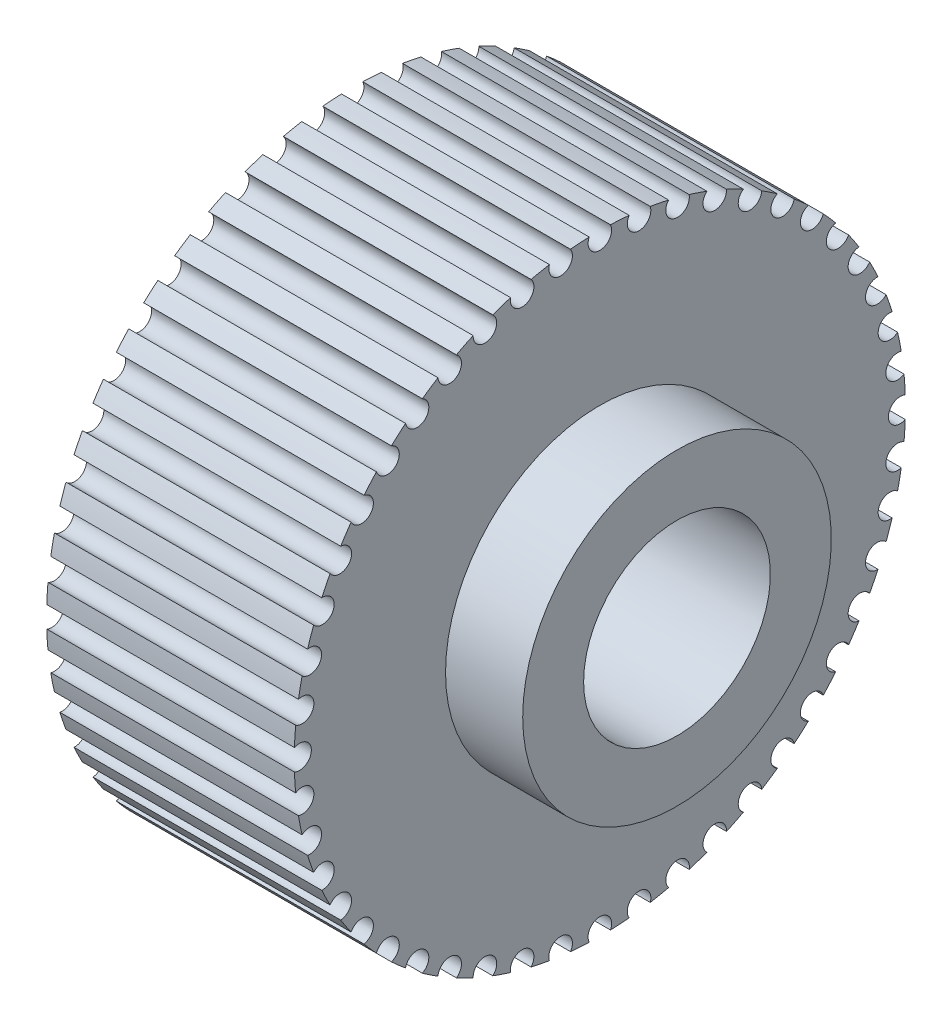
ISO-10303-21;
HEADER;
FILE_DESCRIPTION(('STEP AP214'),'2;1');
FILE_NAME('part.step','',(''),(''),'','','');
FILE_SCHEMA(('AUTOMOTIVE_DESIGN { 1 0 10303 214 1 1 1 1 }'));
ENDSEC;
DATA;
#1=APPLICATION_CONTEXT('core data for automotive mechanical design processes');
#2=APPLICATION_PROTOCOL_DEFINITION('international standard','automotive_design',2000,#1);
#3=PRODUCT_CONTEXT('',#1,'mechanical');
#4=PRODUCT('Part','Part','',(#3));
#5=PRODUCT_RELATED_PRODUCT_CATEGORY('part','',(#4));
#6=PRODUCT_DEFINITION_FORMATION('','',#4);
#7=PRODUCT_DEFINITION_CONTEXT('part definition',#1,'design');
#8=PRODUCT_DEFINITION('design','',#6,#7);
#9=PRODUCT_DEFINITION_SHAPE('','',#8);
#10=(LENGTH_UNIT() NAMED_UNIT(*) SI_UNIT(.MILLI.,.METRE.));
#11=(NAMED_UNIT(*) PLANE_ANGLE_UNIT() SI_UNIT($,.RADIAN.));
#12=(NAMED_UNIT(*) SI_UNIT($,.STERADIAN.) SOLID_ANGLE_UNIT());
#13=UNCERTAINTY_MEASURE_WITH_UNIT(LENGTH_MEASURE(1.E-05),#10,'distance_accuracy_value','');
#14=(GEOMETRIC_REPRESENTATION_CONTEXT(3) GLOBAL_UNCERTAINTY_ASSIGNED_CONTEXT((#13)) GLOBAL_UNIT_ASSIGNED_CONTEXT((#10,
#11,#12)) REPRESENTATION_CONTEXT('',''));
#15=CARTESIAN_POINT('',(0.,0.,0.));
#16=DIRECTION('',(0.,0.,1.));
#17=DIRECTION('',(1.,0.,0.));
#18=AXIS2_PLACEMENT_3D('',#15,#16,#17);
#19=CARTESIAN_POINT('',(0.,0.,0.));
#20=DIRECTION('',(-1.,0.,0.));
#21=DIRECTION('',(0.,0.,1.));
#22=AXIS2_PLACEMENT_3D('',#19,#20,#21);
#23=CYLINDRICAL_SURFACE('',#22,37.625);
#24=CARTESIAN_POINT('',(0.,0.,0.));
#25=DIRECTION('',(-1.,0.,0.));
#26=DIRECTION('',(0.,0.,1.));
#27=AXIS2_PLACEMENT_3D('',#24,#25,#26);
#28=CIRCLE('',#27,37.625);
#29=CARTESIAN_POINT('',(0.,37.4512253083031,3.61197285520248));
#30=VERTEX_POINT('',#29);
#31=CARTESIAN_POINT('',(0.,37.6022819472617,1.30729390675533));
#32=VERTEX_POINT('',#31);
#33=EDGE_CURVE('E651',#30,#32,#28,.T.);
#34=ORIENTED_EDGE('',*,*,#33,.F.);
#35=DIRECTION('',(-1.,0.,0.));
#36=VECTOR('',#35,1.);
#37=CARTESIAN_POINT('',(20.,37.4512253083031,3.61197285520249));
#38=LINE('',#37,#36);
#39=CARTESIAN_POINT('',(30.5,37.4512253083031,3.61197285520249));
#40=VERTEX_POINT('',#39);
#41=EDGE_CURVE('E632',#30,#40,#38,.F.);
#42=ORIENTED_EDGE('',*,*,#41,.T.);
#43=CARTESIAN_POINT('',(30.5,0.,0.));
#44=DIRECTION('',(-1.,0.,0.));
#45=DIRECTION('',(0.,0.,1.));
#46=AXIS2_PLACEMENT_3D('',#43,#44,#45);
#47=CIRCLE('',#46,37.625);
#48=CARTESIAN_POINT('',(30.5,37.6022819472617,1.30729390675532));
#49=VERTEX_POINT('',#48);
#50=EDGE_CURVE('E816',#40,#49,#47,.T.);
#51=ORIENTED_EDGE('',*,*,#50,.T.);
#52=DIRECTION('',(-1.,0.,0.));
#53=VECTOR('',#52,1.);
#54=CARTESIAN_POINT('',(20.,37.6022819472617,1.30729390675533));
#55=LINE('',#54,#53);
#56=EDGE_CURVE('E1371',#49,#32,#55,.T.);
#57=ORIENTED_EDGE('',*,*,#56,.T.);
#58=EDGE_LOOP('',(#34,#42,#51,#57));
#59=FACE_BOUND('',#58,.T.);
#60=ADVANCED_FACE('F38',(#59),#23,.T.);
#61=CARTESIAN_POINT('',(30.5,36.6593678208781,8.46943776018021));
#62=VERTEX_POINT('',#61);
#63=CARTESIAN_POINT('',(30.5,37.1099531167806,6.20419250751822));
#64=VERTEX_POINT('',#63);
#65=EDGE_CURVE('E644',#62,#64,#47,.T.);
#66=ORIENTED_EDGE('',*,*,#65,.T.);
#67=DIRECTION('',(-1.,0.,0.));
#68=VECTOR('',#67,1.);
#69=CARTESIAN_POINT('',(20.,37.1099531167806,6.20419250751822));
#70=LINE('',#69,#68);
#71=CARTESIAN_POINT('',(0.,37.1099531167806,6.20419250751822));
#72=VERTEX_POINT('',#71);
#73=EDGE_CURVE('E53',#64,#72,#70,.T.);
#74=ORIENTED_EDGE('',*,*,#73,.T.);
#75=CARTESIAN_POINT('',(0.,36.6593678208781,8.46943776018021));
#76=VERTEX_POINT('',#75);
#77=EDGE_CURVE('E642',#76,#72,#28,.T.);
#78=ORIENTED_EDGE('',*,*,#77,.F.);
#79=DIRECTION('',(-1.,0.,0.));
#80=VECTOR('',#79,1.);
#81=CARTESIAN_POINT('',(20.,36.6593678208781,8.46943776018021));
#82=LINE('',#81,#80);
#83=EDGE_CURVE('E2288',#76,#62,#82,.F.);
#84=ORIENTED_EDGE('',*,*,#83,.T.);
#85=EDGE_LOOP('',(#66,#74,#78,#84));
#86=FACE_BOUND('',#85,.T.);
#87=ADVANCED_FACE('F640',(#86),#23,.T.);
#88=CARTESIAN_POINT('',(30.5,35.240258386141,13.1819882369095));
#89=VERTEX_POINT('',#88);
#90=CARTESIAN_POINT('',(30.5,35.9826626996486,10.9949356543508));
#91=VERTEX_POINT('',#90);
#92=EDGE_CURVE('E807',#89,#91,#47,.T.);
#93=ORIENTED_EDGE('',*,*,#92,.T.);
#94=DIRECTION('',(-1.,0.,0.));
#95=VECTOR('',#94,1.);
#96=CARTESIAN_POINT('',(20.,35.9826626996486,10.9949356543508));
#97=LINE('',#96,#95);
#98=CARTESIAN_POINT('',(0.,35.9826626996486,10.9949356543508));
#99=VERTEX_POINT('',#98);
#100=EDGE_CURVE('E60',#91,#99,#97,.T.);
#101=ORIENTED_EDGE('',*,*,#100,.T.);
#102=CARTESIAN_POINT('',(0.,35.240258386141,13.1819882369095));
#103=VERTEX_POINT('',#102);
#104=EDGE_CURVE('E650',#103,#99,#28,.T.);
#105=ORIENTED_EDGE('',*,*,#104,.F.);
#106=DIRECTION('',(-1.,0.,0.));
#107=VECTOR('',#106,1.);
#108=CARTESIAN_POINT('',(20.,35.240258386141,13.1819882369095));
#109=LINE('',#108,#107);
#110=EDGE_CURVE('E812',#103,#89,#109,.F.);
#111=ORIENTED_EDGE('',*,*,#110,.T.);
#112=EDGE_LOOP('',(#93,#101,#105,#111));
#113=FACE_BOUND('',#112,.T.);
#114=ADVANCED_FACE('F810',(#113),#23,.T.);
#115=CARTESIAN_POINT('',(30.5,33.2181783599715,17.6689912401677));
#116=VERTEX_POINT('',#115);
#117=CARTESIAN_POINT('',(30.5,34.2396989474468,15.5975524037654));
#118=VERTEX_POINT('',#117);
#119=EDGE_CURVE('E813',#116,#118,#47,.T.);
#120=ORIENTED_EDGE('',*,*,#119,.T.);
#121=DIRECTION('',(-1.,0.,0.));
#122=VECTOR('',#121,1.);
#123=CARTESIAN_POINT('',(20.,34.2396989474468,15.5975524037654));
#124=LINE('',#123,#122);
#125=CARTESIAN_POINT('',(0.,34.2396989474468,15.5975524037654));
#126=VERTEX_POINT('',#125);
#127=EDGE_CURVE('E2296',#118,#126,#124,.T.);
#128=ORIENTED_EDGE('',*,*,#127,.T.);
#129=CARTESIAN_POINT('',(0.,33.2181783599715,17.6689912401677));
#130=VERTEX_POINT('',#129);
#131=EDGE_CURVE('E653',#130,#126,#28,.T.);
#132=ORIENTED_EDGE('',*,*,#131,.F.);
#133=DIRECTION('',(-1.,0.,0.));
#134=VECTOR('',#133,1.);
#135=CARTESIAN_POINT('',(20.,33.2181783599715,17.6689912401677));
#136=LINE('',#135,#134);
#137=EDGE_CURVE('E1095',#130,#116,#136,.F.);
#138=ORIENTED_EDGE('',*,*,#137,.T.);
#139=EDGE_LOOP('',(#120,#128,#132,#138));
#140=FACE_BOUND('',#139,.T.);
#141=ADVANCED_FACE('F1099',(#140),#23,.T.);
#142=CARTESIAN_POINT('',(30.5,30.6277260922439,21.8536729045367));
#143=VERTEX_POINT('',#142);
#144=CARTESIAN_POINT('',(30.5,31.9108844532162,19.9332907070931));
#145=VERTEX_POINT('',#144);
#146=EDGE_CURVE('E815',#143,#145,#47,.T.);
#147=ORIENTED_EDGE('',*,*,#146,.T.);
#148=DIRECTION('',(-1.,0.,0.));
#149=VECTOR('',#148,1.);
#150=CARTESIAN_POINT('',(20.,31.9108844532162,19.9332907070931));
#151=LINE('',#150,#149);
#152=CARTESIAN_POINT('',(0.,31.9108844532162,19.9332907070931));
#153=VERTEX_POINT('',#152);
#154=EDGE_CURVE('E1088',#145,#153,#151,.T.);
#155=ORIENTED_EDGE('',*,*,#154,.T.);
#156=CARTESIAN_POINT('',(0.,30.6277260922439,21.8536729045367));
#157=VERTEX_POINT('',#156);
#158=EDGE_CURVE('E2300',#157,#153,#28,.T.);
#159=ORIENTED_EDGE('',*,*,#158,.F.);
#160=DIRECTION('',(-1.,0.,0.));
#161=VECTOR('',#160,1.);
#162=CARTESIAN_POINT('',(20.,30.6277260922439,21.8536729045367));
#163=LINE('',#162,#161);
#164=EDGE_CURVE('E1090',#157,#143,#163,.F.);
#165=ORIENTED_EDGE('',*,*,#164,.T.);
#166=EDGE_LOOP('',(#147,#155,#159,#165));
#167=FACE_BOUND('',#166,.T.);
#168=ADVANCED_FACE('F1086',(#167),#23,.T.);
#169=CARTESIAN_POINT('',(30.5,27.5132249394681,25.6644321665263));
#170=VERTEX_POINT('',#169);
#171=CARTESIAN_POINT('',(30.5,29.0360658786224,23.9279648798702));
#172=VERTEX_POINT('',#171);
#173=EDGE_CURVE('E1071',#170,#172,#47,.T.);
#174=ORIENTED_EDGE('',*,*,#173,.T.);
#175=DIRECTION('',(-1.,0.,0.));
#176=VECTOR('',#175,1.);
#177=CARTESIAN_POINT('',(20.,29.0360658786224,23.9279648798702));
#178=LINE('',#177,#176);
#179=CARTESIAN_POINT('',(0.,29.0360658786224,23.9279648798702));
#180=VERTEX_POINT('',#179);
#181=EDGE_CURVE('E1104',#172,#180,#178,.T.);
#182=ORIENTED_EDGE('',*,*,#181,.T.);
#183=CARTESIAN_POINT('',(0.,27.5132249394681,25.6644321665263));
#184=VERTEX_POINT('',#183);
#185=EDGE_CURVE('E2302',#184,#180,#28,.T.);
#186=ORIENTED_EDGE('',*,*,#185,.F.);
#187=DIRECTION('',(-1.,0.,0.));
#188=VECTOR('',#187,1.);
#189=CARTESIAN_POINT('',(20.,27.5132249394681,25.6644321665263));
#190=LINE('',#189,#188);
#191=EDGE_CURVE('E1116',#184,#170,#190,.F.);
#192=ORIENTED_EDGE('',*,*,#191,.T.);
#193=EDGE_LOOP('',(#174,#182,#186,#192));
#194=FACE_BOUND('',#193,.T.);
#195=ADVANCED_FACE('F2058',(#194),#23,.T.);
#196=CARTESIAN_POINT('',(30.5,23.9279648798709,29.0360658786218));
#197=VERTEX_POINT('',#196);
#198=CARTESIAN_POINT('',(30.5,25.664432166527,27.5132249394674));
#199=VERTEX_POINT('',#198);
#200=EDGE_CURVE('E1065',#197,#199,#47,.T.);
#201=ORIENTED_EDGE('',*,*,#200,.T.);
#202=DIRECTION('',(-1.,0.,0.));
#203=VECTOR('',#202,1.);
#204=CARTESIAN_POINT('',(20.,25.664432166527,27.5132249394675));
#205=LINE('',#204,#203);
#206=CARTESIAN_POINT('',(0.,25.664432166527,27.5132249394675));
#207=VERTEX_POINT('',#206);
#208=EDGE_CURVE('E1114',#199,#207,#205,.T.);
#209=ORIENTED_EDGE('',*,*,#208,.T.);
#210=CARTESIAN_POINT('',(0.,23.9279648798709,29.0360658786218));
#211=VERTEX_POINT('',#210);
#212=EDGE_CURVE('E2303',#211,#207,#28,.T.);
#213=ORIENTED_EDGE('',*,*,#212,.F.);
#214=DIRECTION('',(-1.,0.,0.));
#215=VECTOR('',#214,1.);
#216=CARTESIAN_POINT('',(20.,23.9279648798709,29.0360658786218));
#217=LINE('',#216,#215);
#218=EDGE_CURVE('E1122',#211,#197,#217,.F.);
#219=ORIENTED_EDGE('',*,*,#218,.T.);
#220=EDGE_LOOP('',(#201,#209,#213,#219));
#221=FACE_BOUND('',#220,.T.);
#222=ADVANCED_FACE('F2052',(#221),#23,.T.);
#223=CARTESIAN_POINT('',(30.5,19.9332907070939,31.9108844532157));
#224=VERTEX_POINT('',#223);
#225=CARTESIAN_POINT('',(30.5,21.8536729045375,30.6277260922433));
#226=VERTEX_POINT('',#225);
#227=EDGE_CURVE('E1059',#224,#226,#47,.T.);
#228=ORIENTED_EDGE('',*,*,#227,.T.);
#229=DIRECTION('',(-1.,0.,0.));
#230=VECTOR('',#229,1.);
#231=CARTESIAN_POINT('',(20.,21.8536729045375,30.6277260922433));
#232=LINE('',#231,#230);
#233=CARTESIAN_POINT('',(0.,21.8536729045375,30.6277260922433));
#234=VERTEX_POINT('',#233);
#235=EDGE_CURVE('E1120',#226,#234,#232,.T.);
#236=ORIENTED_EDGE('',*,*,#235,.T.);
#237=CARTESIAN_POINT('',(0.,19.9332907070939,31.9108844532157));
#238=VERTEX_POINT('',#237);
#239=EDGE_CURVE('E2307',#238,#234,#28,.T.);
#240=ORIENTED_EDGE('',*,*,#239,.F.);
#241=DIRECTION('',(-1.,0.,0.));
#242=VECTOR('',#241,1.);
#243=CARTESIAN_POINT('',(20.,19.9332907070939,31.9108844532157));
#244=LINE('',#243,#242);
#245=EDGE_CURVE('E1128',#238,#224,#244,.F.);
#246=ORIENTED_EDGE('',*,*,#245,.T.);
#247=EDGE_LOOP('',(#228,#236,#240,#246));
#248=FACE_BOUND('',#247,.T.);
#249=ADVANCED_FACE('F2046',(#248),#23,.T.);
#250=CARTESIAN_POINT('',(30.5,15.5975524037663,34.2396989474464));
#251=VERTEX_POINT('',#250);
#252=CARTESIAN_POINT('',(30.5,17.6689912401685,33.218178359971));
#253=VERTEX_POINT('',#252);
#254=EDGE_CURVE('E1053',#251,#253,#47,.T.);
#255=ORIENTED_EDGE('',*,*,#254,.T.);
#256=DIRECTION('',(-1.,0.,0.));
#257=VECTOR('',#256,1.);
#258=CARTESIAN_POINT('',(20.,17.6689912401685,33.218178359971));
#259=LINE('',#258,#257);
#260=CARTESIAN_POINT('',(0.,17.6689912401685,33.218178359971));
#261=VERTEX_POINT('',#260);
#262=EDGE_CURVE('E1126',#253,#261,#259,.T.);
#263=ORIENTED_EDGE('',*,*,#262,.T.);
#264=CARTESIAN_POINT('',(0.,15.5975524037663,34.2396989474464));
#265=VERTEX_POINT('',#264);
#266=EDGE_CURVE('E2311',#265,#261,#28,.T.);
#267=ORIENTED_EDGE('',*,*,#266,.F.);
#268=DIRECTION('',(-1.,0.,0.));
#269=VECTOR('',#268,1.);
#270=CARTESIAN_POINT('',(20.,15.5975524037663,34.2396989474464));
#271=LINE('',#270,#269);
#272=EDGE_CURVE('E1134',#265,#251,#271,.F.);
#273=ORIENTED_EDGE('',*,*,#272,.T.);
#274=EDGE_LOOP('',(#255,#263,#267,#273));
#275=FACE_BOUND('',#274,.T.);
#276=ADVANCED_FACE('F2040',(#275),#23,.T.);
#277=CARTESIAN_POINT('',(30.5,10.9949356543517,35.9826626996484));
#278=VERTEX_POINT('',#277);
#279=CARTESIAN_POINT('',(30.5,13.1819882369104,35.2402583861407));
#280=VERTEX_POINT('',#279);
#281=EDGE_CURVE('E1047',#278,#280,#47,.T.);
#282=ORIENTED_EDGE('',*,*,#281,.T.);
#283=DIRECTION('',(-1.,0.,0.));
#284=VECTOR('',#283,1.);
#285=CARTESIAN_POINT('',(20.,13.1819882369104,35.2402583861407));
#286=LINE('',#285,#284);
#287=CARTESIAN_POINT('',(0.,13.1819882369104,35.2402583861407));
#288=VERTEX_POINT('',#287);
#289=EDGE_CURVE('E1132',#280,#288,#286,.T.);
#290=ORIENTED_EDGE('',*,*,#289,.T.);
#291=CARTESIAN_POINT('',(0.,10.9949356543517,35.9826626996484));
#292=VERTEX_POINT('',#291);
#293=EDGE_CURVE('E2315',#292,#288,#28,.T.);
#294=ORIENTED_EDGE('',*,*,#293,.F.);
#295=DIRECTION('',(-1.,0.,0.));
#296=VECTOR('',#295,1.);
#297=CARTESIAN_POINT('',(20.,10.9949356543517,35.9826626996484));
#298=LINE('',#297,#296);
#299=EDGE_CURVE('E1140',#292,#278,#298,.F.);
#300=ORIENTED_EDGE('',*,*,#299,.T.);
#301=EDGE_LOOP('',(#282,#290,#294,#300));
#302=FACE_BOUND('',#301,.T.);
#303=ADVANCED_FACE('F2034',(#302),#23,.T.);
#304=CARTESIAN_POINT('',(30.5,6.20419250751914,37.1099531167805));
#305=VERTEX_POINT('',#304);
#306=CARTESIAN_POINT('',(30.5,8.46943776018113,36.6593678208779));
#307=VERTEX_POINT('',#306);
#308=EDGE_CURVE('E1041',#305,#307,#47,.T.);
#309=ORIENTED_EDGE('',*,*,#308,.T.);
#310=DIRECTION('',(-1.,0.,0.));
#311=VECTOR('',#310,1.);
#312=CARTESIAN_POINT('',(20.,8.46943776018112,36.6593678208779));
#313=LINE('',#312,#311);
#314=CARTESIAN_POINT('',(0.,8.46943776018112,36.6593678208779));
#315=VERTEX_POINT('',#314);
#316=EDGE_CURVE('E1138',#307,#315,#313,.T.);
#317=ORIENTED_EDGE('',*,*,#316,.T.);
#318=CARTESIAN_POINT('',(0.,6.20419250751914,37.1099531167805));
#319=VERTEX_POINT('',#318);
#320=EDGE_CURVE('E2319',#319,#315,#28,.T.);
#321=ORIENTED_EDGE('',*,*,#320,.F.);
#322=DIRECTION('',(-1.,0.,0.));
#323=VECTOR('',#322,1.);
#324=CARTESIAN_POINT('',(20.,6.20419250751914,37.1099531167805));
#325=LINE('',#324,#323);
#326=EDGE_CURVE('E1146',#319,#305,#325,.F.);
#327=ORIENTED_EDGE('',*,*,#326,.T.);
#328=EDGE_LOOP('',(#309,#317,#321,#327));
#329=FACE_BOUND('',#328,.T.);
#330=ADVANCED_FACE('F2028',(#329),#23,.T.);
#331=CARTESIAN_POINT('',(30.5,1.30729390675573,37.6022819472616));
#332=VERTEX_POINT('',#331);
#333=CARTESIAN_POINT('',(30.5,3.61197285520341,37.451225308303));
#334=VERTEX_POINT('',#333);
#335=EDGE_CURVE('E1035',#332,#334,#47,.T.);
#336=ORIENTED_EDGE('',*,*,#335,.T.);
#337=DIRECTION('',(-1.,0.,0.));
#338=VECTOR('',#337,1.);
#339=CARTESIAN_POINT('',(20.,3.61197285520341,37.451225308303));
#340=LINE('',#339,#338);
#341=CARTESIAN_POINT('',(0.,3.61197285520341,37.451225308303));
#342=VERTEX_POINT('',#341);
#343=EDGE_CURVE('E1144',#334,#342,#340,.T.);
#344=ORIENTED_EDGE('',*,*,#343,.T.);
#345=CARTESIAN_POINT('',(0.,1.30729390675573,37.6022819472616));
#346=VERTEX_POINT('',#345);
#347=EDGE_CURVE('E2323',#346,#342,#28,.T.);
#348=ORIENTED_EDGE('',*,*,#347,.F.);
#349=DIRECTION('',(-1.,0.,0.));
#350=VECTOR('',#349,1.);
#351=CARTESIAN_POINT('',(20.,1.30729390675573,37.6022819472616));
#352=LINE('',#351,#350);
#353=EDGE_CURVE('E1152',#346,#332,#352,.F.);
#354=ORIENTED_EDGE('',*,*,#353,.T.);
#355=EDGE_LOOP('',(#336,#344,#348,#354));
#356=FACE_BOUND('',#355,.T.);
#357=ADVANCED_FACE('F2022',(#356),#23,.T.);
#358=CARTESIAN_POINT('',(30.5,-3.61197285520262,37.4512253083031));
#359=VERTEX_POINT('',#358);
#360=CARTESIAN_POINT('',(30.5,-1.30729390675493,37.6022819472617));
#361=VERTEX_POINT('',#360);
#362=EDGE_CURVE('E1029',#359,#361,#47,.T.);
#363=ORIENTED_EDGE('',*,*,#362,.T.);
#364=DIRECTION('',(-1.,0.,0.));
#365=VECTOR('',#364,1.);
#366=CARTESIAN_POINT('',(20.,-1.30729390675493,37.6022819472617));
#367=LINE('',#366,#365);
#368=CARTESIAN_POINT('',(0.,-1.30729390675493,37.6022819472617));
#369=VERTEX_POINT('',#368);
#370=EDGE_CURVE('E1150',#361,#369,#367,.T.);
#371=ORIENTED_EDGE('',*,*,#370,.T.);
#372=CARTESIAN_POINT('',(0.,-3.61197285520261,37.4512253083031));
#373=VERTEX_POINT('',#372);
#374=EDGE_CURVE('E2327',#373,#369,#28,.T.);
#375=ORIENTED_EDGE('',*,*,#374,.F.);
#376=DIRECTION('',(-1.,0.,0.));
#377=VECTOR('',#376,1.);
#378=CARTESIAN_POINT('',(20.,-3.61197285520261,37.4512253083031));
#379=LINE('',#378,#377);
#380=EDGE_CURVE('E1158',#373,#359,#379,.F.);
#381=ORIENTED_EDGE('',*,*,#380,.T.);
#382=EDGE_LOOP('',(#363,#371,#375,#381));
#383=FACE_BOUND('',#382,.T.);
#384=ADVANCED_FACE('F2016',(#383),#23,.T.);
#385=CARTESIAN_POINT('',(30.5,-8.46943776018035,36.6593678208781));
#386=VERTEX_POINT('',#385);
#387=CARTESIAN_POINT('',(30.5,-6.20419250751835,37.1099531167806));
#388=VERTEX_POINT('',#387);
#389=EDGE_CURVE('E1023',#386,#388,#47,.T.);
#390=ORIENTED_EDGE('',*,*,#389,.T.);
#391=DIRECTION('',(-1.,0.,0.));
#392=VECTOR('',#391,1.);
#393=CARTESIAN_POINT('',(20.,-6.20419250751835,37.1099531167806));
#394=LINE('',#393,#392);
#395=CARTESIAN_POINT('',(0.,-6.20419250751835,37.1099531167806));
#396=VERTEX_POINT('',#395);
#397=EDGE_CURVE('E1156',#388,#396,#394,.T.);
#398=ORIENTED_EDGE('',*,*,#397,.T.);
#399=CARTESIAN_POINT('',(0.,-8.46943776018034,36.6593678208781));
#400=VERTEX_POINT('',#399);
#401=EDGE_CURVE('E2331',#400,#396,#28,.T.);
#402=ORIENTED_EDGE('',*,*,#401,.F.);
#403=DIRECTION('',(-1.,0.,0.));
#404=VECTOR('',#403,1.);
#405=CARTESIAN_POINT('',(20.,-8.46943776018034,36.6593678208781));
#406=LINE('',#405,#404);
#407=EDGE_CURVE('E1164',#400,#386,#406,.F.);
#408=ORIENTED_EDGE('',*,*,#407,.T.);
#409=EDGE_LOOP('',(#390,#398,#402,#408));
#410=FACE_BOUND('',#409,.T.);
#411=ADVANCED_FACE('F2010',(#410),#23,.T.);
#412=CARTESIAN_POINT('',(30.5,-13.1819882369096,35.2402583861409));
#413=VERTEX_POINT('',#412);
#414=CARTESIAN_POINT('',(30.5,-10.994935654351,35.9826626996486));
#415=VERTEX_POINT('',#414);
#416=EDGE_CURVE('E1017',#413,#415,#47,.T.);
#417=ORIENTED_EDGE('',*,*,#416,.T.);
#418=DIRECTION('',(-1.,0.,0.));
#419=VECTOR('',#418,1.);
#420=CARTESIAN_POINT('',(20.,-10.994935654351,35.9826626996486));
#421=LINE('',#420,#419);
#422=CARTESIAN_POINT('',(0.,-10.994935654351,35.9826626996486));
#423=VERTEX_POINT('',#422);
#424=EDGE_CURVE('E1162',#415,#423,#421,.T.);
#425=ORIENTED_EDGE('',*,*,#424,.T.);
#426=CARTESIAN_POINT('',(0.,-13.1819882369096,35.2402583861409));
#427=VERTEX_POINT('',#426);
#428=EDGE_CURVE('E2335',#427,#423,#28,.T.);
#429=ORIENTED_EDGE('',*,*,#428,.F.);
#430=DIRECTION('',(-1.,0.,0.));
#431=VECTOR('',#430,1.);
#432=CARTESIAN_POINT('',(20.,-13.1819882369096,35.2402583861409));
#433=LINE('',#432,#431);
#434=EDGE_CURVE('E1170',#427,#413,#433,.F.);
#435=ORIENTED_EDGE('',*,*,#434,.T.);
#436=EDGE_LOOP('',(#417,#425,#429,#435));
#437=FACE_BOUND('',#436,.T.);
#438=ADVANCED_FACE('F2004',(#437),#23,.T.);
#439=CARTESIAN_POINT('',(30.5,-17.6689912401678,33.2181783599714));
#440=VERTEX_POINT('',#439);
#441=CARTESIAN_POINT('',(30.5,-15.5975524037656,34.2396989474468));
#442=VERTEX_POINT('',#441);
#443=EDGE_CURVE('E1011',#440,#442,#47,.T.);
#444=ORIENTED_EDGE('',*,*,#443,.T.);
#445=DIRECTION('',(-1.,0.,0.));
#446=VECTOR('',#445,1.);
#447=CARTESIAN_POINT('',(20.,-15.5975524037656,34.2396989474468));
#448=LINE('',#447,#446);
#449=CARTESIAN_POINT('',(0.,-15.5975524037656,34.2396989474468));
#450=VERTEX_POINT('',#449);
#451=EDGE_CURVE('E1168',#442,#450,#448,.T.);
#452=ORIENTED_EDGE('',*,*,#451,.T.);
#453=CARTESIAN_POINT('',(0.,-17.6689912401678,33.2181783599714));
#454=VERTEX_POINT('',#453);
#455=EDGE_CURVE('E2339',#454,#450,#28,.T.);
#456=ORIENTED_EDGE('',*,*,#455,.F.);
#457=DIRECTION('',(-1.,0.,0.));
#458=VECTOR('',#457,1.);
#459=CARTESIAN_POINT('',(20.,-17.6689912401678,33.2181783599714));
#460=LINE('',#459,#458);
#461=EDGE_CURVE('E1176',#454,#440,#460,.F.);
#462=ORIENTED_EDGE('',*,*,#461,.T.);
#463=EDGE_LOOP('',(#444,#452,#456,#462));
#464=FACE_BOUND('',#463,.T.);
#465=ADVANCED_FACE('F1998',(#464),#23,.T.);
#466=CARTESIAN_POINT('',(30.5,-21.8536729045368,30.6277260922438));
#467=VERTEX_POINT('',#466);
#468=CARTESIAN_POINT('',(30.5,-19.9332907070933,31.9108844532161));
#469=VERTEX_POINT('',#468);
#470=EDGE_CURVE('E1005',#467,#469,#47,.T.);
#471=ORIENTED_EDGE('',*,*,#470,.T.);
#472=DIRECTION('',(-1.,0.,0.));
#473=VECTOR('',#472,1.);
#474=CARTESIAN_POINT('',(20.,-19.9332907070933,31.9108844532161));
#475=LINE('',#474,#473);
#476=CARTESIAN_POINT('',(0.,-19.9332907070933,31.9108844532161));
#477=VERTEX_POINT('',#476);
#478=EDGE_CURVE('E1174',#469,#477,#475,.T.);
#479=ORIENTED_EDGE('',*,*,#478,.T.);
#480=CARTESIAN_POINT('',(0.,-21.8536729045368,30.6277260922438));
#481=VERTEX_POINT('',#480);
#482=EDGE_CURVE('E2343',#481,#477,#28,.T.);
#483=ORIENTED_EDGE('',*,*,#482,.F.);
#484=DIRECTION('',(-1.,0.,0.));
#485=VECTOR('',#484,1.);
#486=CARTESIAN_POINT('',(20.,-21.8536729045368,30.6277260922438));
#487=LINE('',#486,#485);
#488=EDGE_CURVE('E1183',#481,#467,#487,.F.);
#489=ORIENTED_EDGE('',*,*,#488,.T.);
#490=EDGE_LOOP('',(#471,#479,#483,#489));
#491=FACE_BOUND('',#490,.T.);
#492=ADVANCED_FACE('F1992',(#491),#23,.T.);
#493=CARTESIAN_POINT('',(30.5,-25.6644321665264,27.513224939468));
#494=VERTEX_POINT('',#493);
#495=CARTESIAN_POINT('',(30.5,-23.9279648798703,29.0360658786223));
#496=VERTEX_POINT('',#495);
#497=EDGE_CURVE('E999',#494,#496,#47,.T.);
#498=ORIENTED_EDGE('',*,*,#497,.T.);
#499=DIRECTION('',(-1.,0.,0.));
#500=VECTOR('',#499,1.);
#501=CARTESIAN_POINT('',(20.,-23.9279648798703,29.0360658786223));
#502=LINE('',#501,#500);
#503=CARTESIAN_POINT('',(0.,-23.9279648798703,29.0360658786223));
#504=VERTEX_POINT('',#503);
#505=EDGE_CURVE('E1181',#496,#504,#502,.T.);
#506=ORIENTED_EDGE('',*,*,#505,.T.);
#507=CARTESIAN_POINT('',(0.,-25.6644321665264,27.513224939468));
#508=VERTEX_POINT('',#507);
#509=EDGE_CURVE('E2348',#508,#504,#28,.T.);
#510=ORIENTED_EDGE('',*,*,#509,.F.);
#511=DIRECTION('',(-1.,0.,0.));
#512=VECTOR('',#511,1.);
#513=CARTESIAN_POINT('',(20.,-25.6644321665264,27.513224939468));
#514=LINE('',#513,#512);
#515=EDGE_CURVE('E1190',#508,#494,#514,.F.);
#516=ORIENTED_EDGE('',*,*,#515,.T.);
#517=EDGE_LOOP('',(#498,#506,#510,#516));
#518=FACE_BOUND('',#517,.T.);
#519=ADVANCED_FACE('F1986',(#518),#23,.T.);
#520=CARTESIAN_POINT('',(30.5,-29.0360658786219,23.9279648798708));
#521=VERTEX_POINT('',#520);
#522=CARTESIAN_POINT('',(30.5,-27.5132249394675,25.6644321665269));
#523=VERTEX_POINT('',#522);
#524=EDGE_CURVE('E993',#521,#523,#47,.T.);
#525=ORIENTED_EDGE('',*,*,#524,.T.);
#526=DIRECTION('',(-1.,0.,0.));
#527=VECTOR('',#526,1.);
#528=CARTESIAN_POINT('',(20.,-27.5132249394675,25.6644321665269));
#529=LINE('',#528,#527);
#530=CARTESIAN_POINT('',(0.,-27.5132249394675,25.6644321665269));
#531=VERTEX_POINT('',#530);
#532=EDGE_CURVE('E1188',#523,#531,#529,.T.);
#533=ORIENTED_EDGE('',*,*,#532,.T.);
#534=CARTESIAN_POINT('',(0.,-29.0360658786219,23.9279648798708));
#535=VERTEX_POINT('',#534);
#536=EDGE_CURVE('E2354',#535,#531,#28,.T.);
#537=ORIENTED_EDGE('',*,*,#536,.F.);
#538=DIRECTION('',(-1.,0.,0.));
#539=VECTOR('',#538,1.);
#540=CARTESIAN_POINT('',(20.,-29.0360658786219,23.9279648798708));
#541=LINE('',#540,#539);
#542=EDGE_CURVE('E1198',#535,#521,#541,.F.);
#543=ORIENTED_EDGE('',*,*,#542,.T.);
#544=EDGE_LOOP('',(#525,#533,#537,#543));
#545=FACE_BOUND('',#544,.T.);
#546=ADVANCED_FACE('F1980',(#545),#23,.T.);
#547=CARTESIAN_POINT('',(30.5,-31.9108844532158,19.9332907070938));
#548=VERTEX_POINT('',#547);
#549=CARTESIAN_POINT('',(30.5,-30.6277260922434,21.8536729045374));
#550=VERTEX_POINT('',#549);
#551=EDGE_CURVE('E987',#548,#550,#47,.T.);
#552=ORIENTED_EDGE('',*,*,#551,.T.);
#553=DIRECTION('',(-1.,0.,0.));
#554=VECTOR('',#553,1.);
#555=CARTESIAN_POINT('',(20.,-30.6277260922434,21.8536729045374));
#556=LINE('',#555,#554);
#557=CARTESIAN_POINT('',(0.,-30.6277260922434,21.8536729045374));
#558=VERTEX_POINT('',#557);
#559=EDGE_CURVE('E1196',#550,#558,#556,.T.);
#560=ORIENTED_EDGE('',*,*,#559,.T.);
#561=CARTESIAN_POINT('',(0.,-31.9108844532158,19.9332907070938));
#562=VERTEX_POINT('',#561);
#563=EDGE_CURVE('E2358',#562,#558,#28,.T.);
#564=ORIENTED_EDGE('',*,*,#563,.F.);
#565=DIRECTION('',(-1.,0.,0.));
#566=VECTOR('',#565,1.);
#567=CARTESIAN_POINT('',(20.,-31.9108844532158,19.9332907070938));
#568=LINE('',#567,#566);
#569=EDGE_CURVE('E1204',#562,#548,#568,.F.);
#570=ORIENTED_EDGE('',*,*,#569,.T.);
#571=EDGE_LOOP('',(#552,#560,#564,#570));
#572=FACE_BOUND('',#571,.T.);
#573=ADVANCED_FACE('F1974',(#572),#23,.T.);
#574=CARTESIAN_POINT('',(30.5,-34.2396989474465,15.5975524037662));
#575=VERTEX_POINT('',#574);
#576=CARTESIAN_POINT('',(30.5,-33.2181783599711,17.6689912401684));
#577=VERTEX_POINT('',#576);
#578=EDGE_CURVE('E981',#575,#577,#47,.T.);
#579=ORIENTED_EDGE('',*,*,#578,.T.);
#580=DIRECTION('',(-1.,0.,0.));
#581=VECTOR('',#580,1.);
#582=CARTESIAN_POINT('',(20.,-33.2181783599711,17.6689912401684));
#583=LINE('',#582,#581);
#584=CARTESIAN_POINT('',(0.,-33.2181783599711,17.6689912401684));
#585=VERTEX_POINT('',#584);
#586=EDGE_CURVE('E1202',#577,#585,#583,.T.);
#587=ORIENTED_EDGE('',*,*,#586,.T.);
#588=CARTESIAN_POINT('',(0.,-34.2396989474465,15.5975524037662));
#589=VERTEX_POINT('',#588);
#590=EDGE_CURVE('E2363',#589,#585,#28,.T.);
#591=ORIENTED_EDGE('',*,*,#590,.F.);
#592=DIRECTION('',(-1.,0.,0.));
#593=VECTOR('',#592,1.);
#594=CARTESIAN_POINT('',(20.,-34.2396989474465,15.5975524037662));
#595=LINE('',#594,#593);
#596=EDGE_CURVE('E1210',#589,#575,#595,.F.);
#597=ORIENTED_EDGE('',*,*,#596,.T.);
#598=EDGE_LOOP('',(#579,#587,#591,#597));
#599=FACE_BOUND('',#598,.T.);
#600=ADVANCED_FACE('F1968',(#599),#23,.T.);
#601=CARTESIAN_POINT('',(30.5,-35.9826626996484,10.9949356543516));
#602=VERTEX_POINT('',#601);
#603=CARTESIAN_POINT('',(30.5,-35.2402583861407,13.1819882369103));
#604=VERTEX_POINT('',#603);
#605=EDGE_CURVE('E975',#602,#604,#47,.T.);
#606=ORIENTED_EDGE('',*,*,#605,.T.);
#607=DIRECTION('',(-1.,0.,0.));
#608=VECTOR('',#607,1.);
#609=CARTESIAN_POINT('',(20.,-35.2402583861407,13.1819882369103));
#610=LINE('',#609,#608);
#611=CARTESIAN_POINT('',(0.,-35.2402583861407,13.1819882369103));
#612=VERTEX_POINT('',#611);
#613=EDGE_CURVE('E1208',#604,#612,#610,.T.);
#614=ORIENTED_EDGE('',*,*,#613,.T.);
#615=CARTESIAN_POINT('',(0.,-35.9826626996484,10.9949356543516));
#616=VERTEX_POINT('',#615);
#617=EDGE_CURVE('E2367',#616,#612,#28,.T.);
#618=ORIENTED_EDGE('',*,*,#617,.F.);
#619=DIRECTION('',(-1.,0.,0.));
#620=VECTOR('',#619,1.);
#621=CARTESIAN_POINT('',(20.,-35.9826626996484,10.9949356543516));
#622=LINE('',#621,#620);
#623=EDGE_CURVE('E1216',#616,#602,#622,.F.);
#624=ORIENTED_EDGE('',*,*,#623,.T.);
#625=EDGE_LOOP('',(#606,#614,#618,#624));
#626=FACE_BOUND('',#625,.T.);
#627=ADVANCED_FACE('F1962',(#626),#23,.T.);
#628=CARTESIAN_POINT('',(30.5,-37.1099531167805,6.20419250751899));
#629=VERTEX_POINT('',#628);
#630=CARTESIAN_POINT('',(30.5,-36.6593678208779,8.46943776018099));
#631=VERTEX_POINT('',#630);
#632=EDGE_CURVE('E969',#629,#631,#47,.T.);
#633=ORIENTED_EDGE('',*,*,#632,.T.);
#634=DIRECTION('',(-1.,0.,0.));
#635=VECTOR('',#634,1.);
#636=CARTESIAN_POINT('',(20.,-36.6593678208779,8.46943776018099));
#637=LINE('',#636,#635);
#638=CARTESIAN_POINT('',(0.,-36.6593678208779,8.46943776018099));
#639=VERTEX_POINT('',#638);
#640=EDGE_CURVE('E1214',#631,#639,#637,.T.);
#641=ORIENTED_EDGE('',*,*,#640,.T.);
#642=CARTESIAN_POINT('',(0.,-37.1099531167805,6.20419250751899));
#643=VERTEX_POINT('',#642);
#644=EDGE_CURVE('E2371',#643,#639,#28,.T.);
#645=ORIENTED_EDGE('',*,*,#644,.F.);
#646=DIRECTION('',(-1.,0.,0.));
#647=VECTOR('',#646,1.);
#648=CARTESIAN_POINT('',(20.,-37.1099531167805,6.20419250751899));
#649=LINE('',#648,#647);
#650=EDGE_CURVE('E1222',#643,#629,#649,.F.);
#651=ORIENTED_EDGE('',*,*,#650,.T.);
#652=EDGE_LOOP('',(#633,#641,#645,#651));
#653=FACE_BOUND('',#652,.T.);
#654=ADVANCED_FACE('F1956',(#653),#23,.T.);
#655=CARTESIAN_POINT('',(30.5,-37.6022819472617,1.30729390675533));
#656=VERTEX_POINT('',#655);
#657=CARTESIAN_POINT('',(30.5,-37.451225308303,3.61197285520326));
#658=VERTEX_POINT('',#657);
#659=EDGE_CURVE('E963',#656,#658,#47,.T.);
#660=ORIENTED_EDGE('',*,*,#659,.T.);
#661=DIRECTION('',(-1.,0.,0.));
#662=VECTOR('',#661,1.);
#663=CARTESIAN_POINT('',(20.,-37.451225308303,3.61197285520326));
#664=LINE('',#663,#662);
#665=CARTESIAN_POINT('',(0.,-37.451225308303,3.61197285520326));
#666=VERTEX_POINT('',#665);
#667=EDGE_CURVE('E1220',#658,#666,#664,.T.);
#668=ORIENTED_EDGE('',*,*,#667,.T.);
#669=CARTESIAN_POINT('',(0.,-37.6022819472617,1.30729390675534));
#670=VERTEX_POINT('',#669);
#671=EDGE_CURVE('E2375',#670,#666,#28,.T.);
#672=ORIENTED_EDGE('',*,*,#671,.F.);
#673=DIRECTION('',(-1.,0.,0.));
#674=VECTOR('',#673,1.);
#675=CARTESIAN_POINT('',(20.,-37.6022819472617,1.30729390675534));
#676=LINE('',#675,#674);
#677=EDGE_CURVE('E1228',#670,#656,#676,.F.);
#678=ORIENTED_EDGE('',*,*,#677,.T.);
#679=EDGE_LOOP('',(#660,#668,#672,#678));
#680=FACE_BOUND('',#679,.T.);
#681=ADVANCED_FACE('F1950',(#680),#23,.T.);
#682=CARTESIAN_POINT('',(30.5,-37.451225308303,-3.61197285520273));
#683=VERTEX_POINT('',#682);
#684=CARTESIAN_POINT('',(30.5,-37.6022819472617,-1.30729390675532));
#685=VERTEX_POINT('',#684);
#686=EDGE_CURVE('E957',#683,#685,#47,.T.);
#687=ORIENTED_EDGE('',*,*,#686,.T.);
#688=DIRECTION('',(-1.,0.,0.));
#689=VECTOR('',#688,1.);
#690=CARTESIAN_POINT('',(20.,-37.6022819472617,-1.30729390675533));
#691=LINE('',#690,#689);
#692=CARTESIAN_POINT('',(0.,-37.6022819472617,-1.30729390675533));
#693=VERTEX_POINT('',#692);
#694=EDGE_CURVE('E1226',#685,#693,#691,.T.);
#695=ORIENTED_EDGE('',*,*,#694,.T.);
#696=CARTESIAN_POINT('',(0.,-37.451225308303,-3.61197285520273));
#697=VERTEX_POINT('',#696);
#698=EDGE_CURVE('E2379',#697,#693,#28,.T.);
#699=ORIENTED_EDGE('',*,*,#698,.F.);
#700=DIRECTION('',(-1.,0.,0.));
#701=VECTOR('',#700,1.);
#702=CARTESIAN_POINT('',(20.,-37.451225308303,-3.61197285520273));
#703=LINE('',#702,#701);
#704=EDGE_CURVE('E1234',#697,#683,#703,.F.);
#705=ORIENTED_EDGE('',*,*,#704,.T.);
#706=EDGE_LOOP('',(#687,#695,#699,#705));
#707=FACE_BOUND('',#706,.T.);
#708=ADVANCED_FACE('F1944',(#707),#23,.T.);
#709=CARTESIAN_POINT('',(30.5,-36.6593678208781,-8.46943776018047));
#710=VERTEX_POINT('',#709);
#711=CARTESIAN_POINT('',(30.5,-37.1099531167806,-6.20419250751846));
#712=VERTEX_POINT('',#711);
#713=EDGE_CURVE('E951',#710,#712,#47,.T.);
#714=ORIENTED_EDGE('',*,*,#713,.T.);
#715=DIRECTION('',(-1.,0.,0.));
#716=VECTOR('',#715,1.);
#717=CARTESIAN_POINT('',(20.,-37.1099531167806,-6.20419250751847));
#718=LINE('',#717,#716);
#719=CARTESIAN_POINT('',(0.,-37.1099531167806,-6.20419250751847));
#720=VERTEX_POINT('',#719);
#721=EDGE_CURVE('E1232',#712,#720,#718,.T.);
#722=ORIENTED_EDGE('',*,*,#721,.T.);
#723=CARTESIAN_POINT('',(0.,-36.6593678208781,-8.46943776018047));
#724=VERTEX_POINT('',#723);
#725=EDGE_CURVE('E2383',#724,#720,#28,.T.);
#726=ORIENTED_EDGE('',*,*,#725,.F.);
#727=DIRECTION('',(-1.,0.,0.));
#728=VECTOR('',#727,1.);
#729=CARTESIAN_POINT('',(20.,-36.6593678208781,-8.46943776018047));
#730=LINE('',#729,#728);
#731=EDGE_CURVE('E1240',#724,#710,#730,.F.);
#732=ORIENTED_EDGE('',*,*,#731,.T.);
#733=EDGE_LOOP('',(#714,#722,#726,#732));
#734=FACE_BOUND('',#733,.T.);
#735=ADVANCED_FACE('F1938',(#734),#23,.T.);
#736=CARTESIAN_POINT('',(30.5,-35.2402583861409,-13.1819882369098));
#737=VERTEX_POINT('',#736);
#738=CARTESIAN_POINT('',(30.5,-35.9826626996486,-10.9949356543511));
#739=VERTEX_POINT('',#738);
#740=EDGE_CURVE('E945',#737,#739,#47,.T.);
#741=ORIENTED_EDGE('',*,*,#740,.T.);
#742=DIRECTION('',(-1.,0.,0.));
#743=VECTOR('',#742,1.);
#744=CARTESIAN_POINT('',(20.,-35.9826626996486,-10.9949356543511));
#745=LINE('',#744,#743);
#746=CARTESIAN_POINT('',(0.,-35.9826626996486,-10.9949356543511));
#747=VERTEX_POINT('',#746);
#748=EDGE_CURVE('E1238',#739,#747,#745,.T.);
#749=ORIENTED_EDGE('',*,*,#748,.T.);
#750=CARTESIAN_POINT('',(0.,-35.2402583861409,-13.1819882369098));
#751=VERTEX_POINT('',#750);
#752=EDGE_CURVE('E2387',#751,#747,#28,.T.);
#753=ORIENTED_EDGE('',*,*,#752,.F.);
#754=DIRECTION('',(-1.,0.,0.));
#755=VECTOR('',#754,1.);
#756=CARTESIAN_POINT('',(20.,-35.2402583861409,-13.1819882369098));
#757=LINE('',#756,#755);
#758=EDGE_CURVE('E1246',#751,#737,#757,.F.);
#759=ORIENTED_EDGE('',*,*,#758,.T.);
#760=EDGE_LOOP('',(#741,#749,#753,#759));
#761=FACE_BOUND('',#760,.T.);
#762=ADVANCED_FACE('F1932',(#761),#23,.T.);
#763=CARTESIAN_POINT('',(30.5,-33.2181783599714,-17.6689912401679));
#764=VERTEX_POINT('',#763);
#765=CARTESIAN_POINT('',(30.5,-34.2396989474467,-15.5975524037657));
#766=VERTEX_POINT('',#765);
#767=EDGE_CURVE('E939',#764,#766,#47,.T.);
#768=ORIENTED_EDGE('',*,*,#767,.T.);
#769=DIRECTION('',(-1.,0.,0.));
#770=VECTOR('',#769,1.);
#771=CARTESIAN_POINT('',(20.,-34.2396989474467,-15.5975524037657));
#772=LINE('',#771,#770);
#773=CARTESIAN_POINT('',(0.,-34.2396989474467,-15.5975524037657));
#774=VERTEX_POINT('',#773);
#775=EDGE_CURVE('E1244',#766,#774,#772,.T.);
#776=ORIENTED_EDGE('',*,*,#775,.T.);
#777=CARTESIAN_POINT('',(0.,-33.2181783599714,-17.6689912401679));
#778=VERTEX_POINT('',#777);
#779=EDGE_CURVE('E2391',#778,#774,#28,.T.);
#780=ORIENTED_EDGE('',*,*,#779,.F.);
#781=DIRECTION('',(-1.,0.,0.));
#782=VECTOR('',#781,1.);
#783=CARTESIAN_POINT('',(20.,-33.2181783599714,-17.6689912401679));
#784=LINE('',#783,#782);
#785=EDGE_CURVE('E1252',#778,#764,#784,.F.);
#786=ORIENTED_EDGE('',*,*,#785,.T.);
#787=EDGE_LOOP('',(#768,#776,#780,#786));
#788=FACE_BOUND('',#787,.T.);
#789=ADVANCED_FACE('F1926',(#788),#23,.T.);
#790=CARTESIAN_POINT('',(30.5,-30.6277260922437,-21.8536729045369));
#791=VERTEX_POINT('',#790);
#792=CARTESIAN_POINT('',(30.5,-31.910884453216,-19.9332907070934));
#793=VERTEX_POINT('',#792);
#794=EDGE_CURVE('E933',#791,#793,#47,.T.);
#795=ORIENTED_EDGE('',*,*,#794,.T.);
#796=DIRECTION('',(-1.,0.,0.));
#797=VECTOR('',#796,1.);
#798=CARTESIAN_POINT('',(20.,-31.910884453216,-19.9332907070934));
#799=LINE('',#798,#797);
#800=CARTESIAN_POINT('',(0.,-31.910884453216,-19.9332907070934));
#801=VERTEX_POINT('',#800);
#802=EDGE_CURVE('E1250',#793,#801,#799,.T.);
#803=ORIENTED_EDGE('',*,*,#802,.T.);
#804=CARTESIAN_POINT('',(0.,-30.6277260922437,-21.8536729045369));
#805=VERTEX_POINT('',#804);
#806=EDGE_CURVE('E2395',#805,#801,#28,.T.);
#807=ORIENTED_EDGE('',*,*,#806,.F.);
#808=DIRECTION('',(-1.,0.,0.));
#809=VECTOR('',#808,1.);
#810=CARTESIAN_POINT('',(20.,-30.6277260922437,-21.8536729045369));
#811=LINE('',#810,#809);
#812=EDGE_CURVE('E1258',#805,#791,#811,.F.);
#813=ORIENTED_EDGE('',*,*,#812,.T.);
#814=EDGE_LOOP('',(#795,#803,#807,#813));
#815=FACE_BOUND('',#814,.T.);
#816=ADVANCED_FACE('F1920',(#815),#23,.T.);
#817=CARTESIAN_POINT('',(30.5,-27.5132249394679,-25.6644321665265));
#818=VERTEX_POINT('',#817);
#819=CARTESIAN_POINT('',(30.5,-29.0360658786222,-23.9279648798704));
#820=VERTEX_POINT('',#819);
#821=EDGE_CURVE('E927',#818,#820,#47,.T.);
#822=ORIENTED_EDGE('',*,*,#821,.T.);
#823=DIRECTION('',(-1.,0.,0.));
#824=VECTOR('',#823,1.);
#825=CARTESIAN_POINT('',(20.,-29.0360658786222,-23.9279648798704));
#826=LINE('',#825,#824);
#827=CARTESIAN_POINT('',(0.,-29.0360658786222,-23.9279648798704));
#828=VERTEX_POINT('',#827);
#829=EDGE_CURVE('E1256',#820,#828,#826,.T.);
#830=ORIENTED_EDGE('',*,*,#829,.T.);
#831=CARTESIAN_POINT('',(0.,-27.5132249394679,-25.6644321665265));
#832=VERTEX_POINT('',#831);
#833=EDGE_CURVE('E2399',#832,#828,#28,.T.);
#834=ORIENTED_EDGE('',*,*,#833,.F.);
#835=DIRECTION('',(-1.,0.,0.));
#836=VECTOR('',#835,1.);
#837=CARTESIAN_POINT('',(20.,-27.5132249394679,-25.6644321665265));
#838=LINE('',#837,#836);
#839=EDGE_CURVE('E1264',#832,#818,#838,.F.);
#840=ORIENTED_EDGE('',*,*,#839,.T.);
#841=EDGE_LOOP('',(#822,#830,#834,#840));
#842=FACE_BOUND('',#841,.T.);
#843=ADVANCED_FACE('F1914',(#842),#23,.T.);
#844=CARTESIAN_POINT('',(30.5,-23.9279648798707,-29.036065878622));
#845=VERTEX_POINT('',#844);
#846=CARTESIAN_POINT('',(30.5,-25.6644321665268,-27.5132249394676));
#847=VERTEX_POINT('',#846);
#848=EDGE_CURVE('E921',#845,#847,#47,.T.);
#849=ORIENTED_EDGE('',*,*,#848,.T.);
#850=DIRECTION('',(-1.,0.,0.));
#851=VECTOR('',#850,1.);
#852=CARTESIAN_POINT('',(20.,-25.6644321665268,-27.5132249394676));
#853=LINE('',#852,#851);
#854=CARTESIAN_POINT('',(0.,-25.6644321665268,-27.5132249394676));
#855=VERTEX_POINT('',#854);
#856=EDGE_CURVE('E1262',#847,#855,#853,.T.);
#857=ORIENTED_EDGE('',*,*,#856,.T.);
#858=CARTESIAN_POINT('',(0.,-23.9279648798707,-29.036065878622));
#859=VERTEX_POINT('',#858);
#860=EDGE_CURVE('E2403',#859,#855,#28,.T.);
#861=ORIENTED_EDGE('',*,*,#860,.F.);
#862=DIRECTION('',(-1.,0.,0.));
#863=VECTOR('',#862,1.);
#864=CARTESIAN_POINT('',(20.,-23.9279648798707,-29.036065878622));
#865=LINE('',#864,#863);
#866=EDGE_CURVE('E1270',#859,#845,#865,.F.);
#867=ORIENTED_EDGE('',*,*,#866,.T.);
#868=EDGE_LOOP('',(#849,#857,#861,#867));
#869=FACE_BOUND('',#868,.T.);
#870=ADVANCED_FACE('F1908',(#869),#23,.T.);
#871=CARTESIAN_POINT('',(30.5,-19.9332907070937,-31.9108844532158));
#872=VERTEX_POINT('',#871);
#873=CARTESIAN_POINT('',(30.5,-21.8536729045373,-30.6277260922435));
#874=VERTEX_POINT('',#873);
#875=EDGE_CURVE('E915',#872,#874,#47,.T.);
#876=ORIENTED_EDGE('',*,*,#875,.T.);
#877=DIRECTION('',(-1.,0.,0.));
#878=VECTOR('',#877,1.);
#879=CARTESIAN_POINT('',(20.,-21.8536729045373,-30.6277260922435));
#880=LINE('',#879,#878);
#881=CARTESIAN_POINT('',(0.,-21.8536729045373,-30.6277260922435));
#882=VERTEX_POINT('',#881);
#883=EDGE_CURVE('E1268',#874,#882,#880,.T.);
#884=ORIENTED_EDGE('',*,*,#883,.T.);
#885=CARTESIAN_POINT('',(0.,-19.9332907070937,-31.9108844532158));
#886=VERTEX_POINT('',#885);
#887=EDGE_CURVE('E2407',#886,#882,#28,.T.);
#888=ORIENTED_EDGE('',*,*,#887,.F.);
#889=DIRECTION('',(-1.,0.,0.));
#890=VECTOR('',#889,1.);
#891=CARTESIAN_POINT('',(20.,-19.9332907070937,-31.9108844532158));
#892=LINE('',#891,#890);
#893=EDGE_CURVE('E1276',#886,#872,#892,.F.);
#894=ORIENTED_EDGE('',*,*,#893,.T.);
#895=EDGE_LOOP('',(#876,#884,#888,#894));
#896=FACE_BOUND('',#895,.T.);
#897=ADVANCED_FACE('F1902',(#896),#23,.T.);
#898=CARTESIAN_POINT('',(30.5,-15.5975524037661,-34.2396989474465));
#899=VERTEX_POINT('',#898);
#900=CARTESIAN_POINT('',(30.5,-17.6689912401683,-33.2181783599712));
#901=VERTEX_POINT('',#900);
#902=EDGE_CURVE('E909',#899,#901,#47,.T.);
#903=ORIENTED_EDGE('',*,*,#902,.T.);
#904=DIRECTION('',(-1.,0.,0.));
#905=VECTOR('',#904,1.);
#906=CARTESIAN_POINT('',(20.,-17.6689912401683,-33.2181783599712));
#907=LINE('',#906,#905);
#908=CARTESIAN_POINT('',(0.,-17.6689912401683,-33.2181783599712));
#909=VERTEX_POINT('',#908);
#910=EDGE_CURVE('E1274',#901,#909,#907,.T.);
#911=ORIENTED_EDGE('',*,*,#910,.T.);
#912=CARTESIAN_POINT('',(0.,-15.5975524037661,-34.2396989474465));
#913=VERTEX_POINT('',#912);
#914=EDGE_CURVE('E2411',#913,#909,#28,.T.);
#915=ORIENTED_EDGE('',*,*,#914,.F.);
#916=DIRECTION('',(-1.,0.,0.));
#917=VECTOR('',#916,1.);
#918=CARTESIAN_POINT('',(20.,-15.5975524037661,-34.2396989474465));
#919=LINE('',#918,#917);
#920=EDGE_CURVE('E1282',#913,#899,#919,.F.);
#921=ORIENTED_EDGE('',*,*,#920,.T.);
#922=EDGE_LOOP('',(#903,#911,#915,#921));
#923=FACE_BOUND('',#922,.T.);
#924=ADVANCED_FACE('F1896',(#923),#23,.T.);
#925=CARTESIAN_POINT('',(30.5,-10.9949356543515,-35.9826626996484));
#926=VERTEX_POINT('',#925);
#927=CARTESIAN_POINT('',(30.5,-13.1819882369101,-35.2402583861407));
#928=VERTEX_POINT('',#927);
#929=EDGE_CURVE('E903',#926,#928,#47,.T.);
#930=ORIENTED_EDGE('',*,*,#929,.T.);
#931=DIRECTION('',(-1.,0.,0.));
#932=VECTOR('',#931,1.);
#933=CARTESIAN_POINT('',(20.,-13.1819882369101,-35.2402583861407));
#934=LINE('',#933,#932);
#935=CARTESIAN_POINT('',(0.,-13.1819882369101,-35.2402583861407));
#936=VERTEX_POINT('',#935);
#937=EDGE_CURVE('E1280',#928,#936,#934,.T.);
#938=ORIENTED_EDGE('',*,*,#937,.T.);
#939=CARTESIAN_POINT('',(0.,-10.9949356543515,-35.9826626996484));
#940=VERTEX_POINT('',#939);
#941=EDGE_CURVE('E2415',#940,#936,#28,.T.);
#942=ORIENTED_EDGE('',*,*,#941,.F.);
#943=DIRECTION('',(-1.,0.,0.));
#944=VECTOR('',#943,1.);
#945=CARTESIAN_POINT('',(20.,-10.9949356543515,-35.9826626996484));
#946=LINE('',#945,#944);
#947=EDGE_CURVE('E1288',#940,#926,#946,.F.);
#948=ORIENTED_EDGE('',*,*,#947,.T.);
#949=EDGE_LOOP('',(#930,#938,#942,#948));
#950=FACE_BOUND('',#949,.T.);
#951=ADVANCED_FACE('F1890',(#950),#23,.T.);
#952=CARTESIAN_POINT('',(30.5,-6.20419250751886,-37.1099531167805));
#953=VERTEX_POINT('',#952);
#954=CARTESIAN_POINT('',(30.5,-8.46943776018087,-36.659367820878));
#955=VERTEX_POINT('',#954);
#956=EDGE_CURVE('E897',#953,#955,#47,.T.);
#957=ORIENTED_EDGE('',*,*,#956,.T.);
#958=DIRECTION('',(-1.,0.,0.));
#959=VECTOR('',#958,1.);
#960=CARTESIAN_POINT('',(20.,-8.46943776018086,-36.659367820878));
#961=LINE('',#960,#959);
#962=CARTESIAN_POINT('',(0.,-8.46943776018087,-36.659367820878));
#963=VERTEX_POINT('',#962);
#964=EDGE_CURVE('E1286',#955,#963,#961,.T.);
#965=ORIENTED_EDGE('',*,*,#964,.T.);
#966=CARTESIAN_POINT('',(0.,-6.20419250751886,-37.1099531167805));
#967=VERTEX_POINT('',#966);
#968=EDGE_CURVE('E2419',#967,#963,#28,.T.);
#969=ORIENTED_EDGE('',*,*,#968,.F.);
#970=DIRECTION('',(-1.,0.,0.));
#971=VECTOR('',#970,1.);
#972=CARTESIAN_POINT('',(20.,-6.20419250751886,-37.1099531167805));
#973=LINE('',#972,#971);
#974=EDGE_CURVE('E1294',#967,#953,#973,.F.);
#975=ORIENTED_EDGE('',*,*,#974,.T.);
#976=EDGE_LOOP('',(#957,#965,#969,#975));
#977=FACE_BOUND('',#976,.T.);
#978=ADVANCED_FACE('F1884',(#977),#23,.T.);
#979=CARTESIAN_POINT('',(30.5,-1.30729390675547,-37.6022819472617));
#980=VERTEX_POINT('',#979);
#981=CARTESIAN_POINT('',(30.5,-3.61197285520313,-37.451225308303));
#982=VERTEX_POINT('',#981);
#983=EDGE_CURVE('E891',#980,#982,#47,.T.);
#984=ORIENTED_EDGE('',*,*,#983,.T.);
#985=DIRECTION('',(-1.,0.,0.));
#986=VECTOR('',#985,1.);
#987=CARTESIAN_POINT('',(20.,-3.61197285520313,-37.451225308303));
#988=LINE('',#987,#986);
#989=CARTESIAN_POINT('',(0.,-3.61197285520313,-37.451225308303));
#990=VERTEX_POINT('',#989);
#991=EDGE_CURVE('E1292',#982,#990,#988,.T.);
#992=ORIENTED_EDGE('',*,*,#991,.T.);
#993=CARTESIAN_POINT('',(0.,-1.30729390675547,-37.6022819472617));
#994=VERTEX_POINT('',#993);
#995=EDGE_CURVE('E2423',#994,#990,#28,.T.);
#996=ORIENTED_EDGE('',*,*,#995,.F.);
#997=DIRECTION('',(-1.,0.,0.));
#998=VECTOR('',#997,1.);
#999=CARTESIAN_POINT('',(20.,-1.30729390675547,-37.6022819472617));
#1000=LINE('',#999,#998);
#1001=EDGE_CURVE('E1300',#994,#980,#1000,.F.);
#1002=ORIENTED_EDGE('',*,*,#1001,.T.);
#1003=EDGE_LOOP('',(#984,#992,#996,#1002));
#1004=FACE_BOUND('',#1003,.T.);
#1005=ADVANCED_FACE('F1878',(#1004),#23,.T.);
#1006=CARTESIAN_POINT('',(30.5,3.61197285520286,-37.451225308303));
#1007=VERTEX_POINT('',#1006);
#1008=CARTESIAN_POINT('',(30.5,1.30729390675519,-37.6022819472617));
#1009=VERTEX_POINT('',#1008);
#1010=EDGE_CURVE('E885',#1007,#1009,#47,.T.);
#1011=ORIENTED_EDGE('',*,*,#1010,.T.);
#1012=DIRECTION('',(-1.,0.,0.));
#1013=VECTOR('',#1012,1.);
#1014=CARTESIAN_POINT('',(20.,1.3072939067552,-37.6022819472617));
#1015=LINE('',#1014,#1013);
#1016=CARTESIAN_POINT('',(0.,1.3072939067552,-37.6022819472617));
#1017=VERTEX_POINT('',#1016);
#1018=EDGE_CURVE('E1298',#1009,#1017,#1015,.T.);
#1019=ORIENTED_EDGE('',*,*,#1018,.T.);
#1020=CARTESIAN_POINT('',(0.,3.61197285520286,-37.451225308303));
#1021=VERTEX_POINT('',#1020);
#1022=EDGE_CURVE('E2427',#1021,#1017,#28,.T.);
#1023=ORIENTED_EDGE('',*,*,#1022,.F.);
#1024=DIRECTION('',(-1.,0.,0.));
#1025=VECTOR('',#1024,1.);
#1026=CARTESIAN_POINT('',(20.,3.61197285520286,-37.451225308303));
#1027=LINE('',#1026,#1025);
#1028=EDGE_CURVE('E1306',#1021,#1007,#1027,.F.);
#1029=ORIENTED_EDGE('',*,*,#1028,.T.);
#1030=EDGE_LOOP('',(#1011,#1019,#1023,#1029));
#1031=FACE_BOUND('',#1030,.T.);
#1032=ADVANCED_FACE('F1872',(#1031),#23,.T.);
#1033=CARTESIAN_POINT('',(30.5,8.4694377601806,-36.659367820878));
#1034=VERTEX_POINT('',#1033);
#1035=CARTESIAN_POINT('',(30.5,6.20419250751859,-37.1099531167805));
#1036=VERTEX_POINT('',#1035);
#1037=EDGE_CURVE('E879',#1034,#1036,#47,.T.);
#1038=ORIENTED_EDGE('',*,*,#1037,.T.);
#1039=DIRECTION('',(-1.,0.,0.));
#1040=VECTOR('',#1039,1.);
#1041=CARTESIAN_POINT('',(20.,6.2041925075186,-37.1099531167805));
#1042=LINE('',#1041,#1040);
#1043=CARTESIAN_POINT('',(0.,6.2041925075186,-37.1099531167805));
#1044=VERTEX_POINT('',#1043);
#1045=EDGE_CURVE('E1304',#1036,#1044,#1042,.T.);
#1046=ORIENTED_EDGE('',*,*,#1045,.T.);
#1047=CARTESIAN_POINT('',(0.,8.46943776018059,-36.659367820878));
#1048=VERTEX_POINT('',#1047);
#1049=EDGE_CURVE('E2431',#1048,#1044,#28,.T.);
#1050=ORIENTED_EDGE('',*,*,#1049,.F.);
#1051=DIRECTION('',(-1.,0.,0.));
#1052=VECTOR('',#1051,1.);
#1053=CARTESIAN_POINT('',(20.,8.46943776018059,-36.659367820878));
#1054=LINE('',#1053,#1052);
#1055=EDGE_CURVE('E1312',#1048,#1034,#1054,.F.);
#1056=ORIENTED_EDGE('',*,*,#1055,.T.);
#1057=EDGE_LOOP('',(#1038,#1046,#1050,#1056));
#1058=FACE_BOUND('',#1057,.T.);
#1059=ADVANCED_FACE('F1866',(#1058),#23,.T.);
#1060=CARTESIAN_POINT('',(30.5,13.1819882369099,-35.2402583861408));
#1061=VERTEX_POINT('',#1060);
#1062=CARTESIAN_POINT('',(30.5,10.9949356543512,-35.9826626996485));
#1063=VERTEX_POINT('',#1062);
#1064=EDGE_CURVE('E873',#1061,#1063,#47,.T.);
#1065=ORIENTED_EDGE('',*,*,#1064,.T.);
#1066=DIRECTION('',(-1.,0.,0.));
#1067=VECTOR('',#1066,1.);
#1068=CARTESIAN_POINT('',(20.,10.9949356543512,-35.9826626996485));
#1069=LINE('',#1068,#1067);
#1070=CARTESIAN_POINT('',(0.,10.9949356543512,-35.9826626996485));
#1071=VERTEX_POINT('',#1070);
#1072=EDGE_CURVE('E1310',#1063,#1071,#1069,.T.);
#1073=ORIENTED_EDGE('',*,*,#1072,.T.);
#1074=CARTESIAN_POINT('',(0.,13.1819882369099,-35.2402583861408));
#1075=VERTEX_POINT('',#1074);
#1076=EDGE_CURVE('E2435',#1075,#1071,#28,.T.);
#1077=ORIENTED_EDGE('',*,*,#1076,.F.);
#1078=DIRECTION('',(-1.,0.,0.));
#1079=VECTOR('',#1078,1.);
#1080=CARTESIAN_POINT('',(20.,13.1819882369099,-35.2402583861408));
#1081=LINE('',#1080,#1079);
#1082=EDGE_CURVE('E1318',#1075,#1061,#1081,.F.);
#1083=ORIENTED_EDGE('',*,*,#1082,.T.);
#1084=EDGE_LOOP('',(#1065,#1073,#1077,#1083));
#1085=FACE_BOUND('',#1084,.T.);
#1086=ADVANCED_FACE('F1860',(#1085),#23,.T.);
#1087=CARTESIAN_POINT('',(30.5,17.668991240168,-33.2181783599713));
#1088=VERTEX_POINT('',#1087);
#1089=CARTESIAN_POINT('',(30.5,15.5975524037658,-34.2396989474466));
#1090=VERTEX_POINT('',#1089);
#1091=EDGE_CURVE('E867',#1088,#1090,#47,.T.);
#1092=ORIENTED_EDGE('',*,*,#1091,.T.);
#1093=DIRECTION('',(-1.,0.,0.));
#1094=VECTOR('',#1093,1.);
#1095=CARTESIAN_POINT('',(20.,15.5975524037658,-34.2396989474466));
#1096=LINE('',#1095,#1094);
#1097=CARTESIAN_POINT('',(0.,15.5975524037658,-34.2396989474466));
#1098=VERTEX_POINT('',#1097);
#1099=EDGE_CURVE('E1316',#1090,#1098,#1096,.T.);
#1100=ORIENTED_EDGE('',*,*,#1099,.T.);
#1101=CARTESIAN_POINT('',(0.,17.668991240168,-33.2181783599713));
#1102=VERTEX_POINT('',#1101);
#1103=EDGE_CURVE('E2439',#1102,#1098,#28,.T.);
#1104=ORIENTED_EDGE('',*,*,#1103,.F.);
#1105=DIRECTION('',(-1.,0.,0.));
#1106=VECTOR('',#1105,1.);
#1107=CARTESIAN_POINT('',(20.,17.668991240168,-33.2181783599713));
#1108=LINE('',#1107,#1106);
#1109=EDGE_CURVE('E1324',#1102,#1088,#1108,.F.);
#1110=ORIENTED_EDGE('',*,*,#1109,.T.);
#1111=EDGE_LOOP('',(#1092,#1100,#1104,#1110));
#1112=FACE_BOUND('',#1111,.T.);
#1113=ADVANCED_FACE('F1854',(#1112),#23,.T.);
#1114=CARTESIAN_POINT('',(30.5,21.853672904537,-30.6277260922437));
#1115=VERTEX_POINT('',#1114);
#1116=CARTESIAN_POINT('',(30.5,19.9332907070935,-31.910884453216));
#1117=VERTEX_POINT('',#1116);
#1118=EDGE_CURVE('E861',#1115,#1117,#47,.T.);
#1119=ORIENTED_EDGE('',*,*,#1118,.T.);
#1120=DIRECTION('',(-1.,0.,0.));
#1121=VECTOR('',#1120,1.);
#1122=CARTESIAN_POINT('',(20.,19.9332907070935,-31.910884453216));
#1123=LINE('',#1122,#1121);
#1124=CARTESIAN_POINT('',(0.,19.9332907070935,-31.910884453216));
#1125=VERTEX_POINT('',#1124);
#1126=EDGE_CURVE('E1322',#1117,#1125,#1123,.T.);
#1127=ORIENTED_EDGE('',*,*,#1126,.T.);
#1128=CARTESIAN_POINT('',(0.,21.853672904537,-30.6277260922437));
#1129=VERTEX_POINT('',#1128);
#1130=EDGE_CURVE('E2443',#1129,#1125,#28,.T.);
#1131=ORIENTED_EDGE('',*,*,#1130,.F.);
#1132=DIRECTION('',(-1.,0.,0.));
#1133=VECTOR('',#1132,1.);
#1134=CARTESIAN_POINT('',(20.,21.853672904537,-30.6277260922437));
#1135=LINE('',#1134,#1133);
#1136=EDGE_CURVE('E1330',#1129,#1115,#1135,.F.);
#1137=ORIENTED_EDGE('',*,*,#1136,.T.);
#1138=EDGE_LOOP('',(#1119,#1127,#1131,#1137));
#1139=FACE_BOUND('',#1138,.T.);
#1140=ADVANCED_FACE('F1848',(#1139),#23,.T.);
#1141=CARTESIAN_POINT('',(30.5,25.6644321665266,-27.5132249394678));
#1142=VERTEX_POINT('',#1141);
#1143=CARTESIAN_POINT('',(30.5,23.9279648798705,-29.0360658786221));
#1144=VERTEX_POINT('',#1143);
#1145=EDGE_CURVE('E855',#1142,#1144,#47,.T.);
#1146=ORIENTED_EDGE('',*,*,#1145,.T.);
#1147=DIRECTION('',(-1.,0.,0.));
#1148=VECTOR('',#1147,1.);
#1149=CARTESIAN_POINT('',(20.,23.9279648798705,-29.0360658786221));
#1150=LINE('',#1149,#1148);
#1151=CARTESIAN_POINT('',(0.,23.9279648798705,-29.0360658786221));
#1152=VERTEX_POINT('',#1151);
#1153=EDGE_CURVE('E1328',#1144,#1152,#1150,.T.);
#1154=ORIENTED_EDGE('',*,*,#1153,.T.);
#1155=CARTESIAN_POINT('',(0.,25.6644321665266,-27.5132249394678));
#1156=VERTEX_POINT('',#1155);
#1157=EDGE_CURVE('E2447',#1156,#1152,#28,.T.);
#1158=ORIENTED_EDGE('',*,*,#1157,.F.);
#1159=DIRECTION('',(-1.,0.,0.));
#1160=VECTOR('',#1159,1.);
#1161=CARTESIAN_POINT('',(20.,25.6644321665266,-27.5132249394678));
#1162=LINE('',#1161,#1160);
#1163=EDGE_CURVE('E1336',#1156,#1142,#1162,.F.);
#1164=ORIENTED_EDGE('',*,*,#1163,.T.);
#1165=EDGE_LOOP('',(#1146,#1154,#1158,#1164));
#1166=FACE_BOUND('',#1165,.T.);
#1167=ADVANCED_FACE('F1842',(#1166),#23,.T.);
#1168=CARTESIAN_POINT('',(30.5,29.036065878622,-23.9279648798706));
#1169=VERTEX_POINT('',#1168);
#1170=CARTESIAN_POINT('',(30.5,27.5132249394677,-25.6644321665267));
#1171=VERTEX_POINT('',#1170);
#1172=EDGE_CURVE('E849',#1169,#1171,#47,.T.);
#1173=ORIENTED_EDGE('',*,*,#1172,.T.);
#1174=DIRECTION('',(-1.,0.,0.));
#1175=VECTOR('',#1174,1.);
#1176=CARTESIAN_POINT('',(20.,27.5132249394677,-25.6644321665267));
#1177=LINE('',#1176,#1175);
#1178=CARTESIAN_POINT('',(0.,27.5132249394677,-25.6644321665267));
#1179=VERTEX_POINT('',#1178);
#1180=EDGE_CURVE('E1334',#1171,#1179,#1177,.T.);
#1181=ORIENTED_EDGE('',*,*,#1180,.T.);
#1182=CARTESIAN_POINT('',(0.,29.036065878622,-23.9279648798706));
#1183=VERTEX_POINT('',#1182);
#1184=EDGE_CURVE('E2451',#1183,#1179,#28,.T.);
#1185=ORIENTED_EDGE('',*,*,#1184,.F.);
#1186=DIRECTION('',(-1.,0.,0.));
#1187=VECTOR('',#1186,1.);
#1188=CARTESIAN_POINT('',(20.,29.036065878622,-23.9279648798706));
#1189=LINE('',#1188,#1187);
#1190=EDGE_CURVE('E1342',#1183,#1169,#1189,.F.);
#1191=ORIENTED_EDGE('',*,*,#1190,.T.);
#1192=EDGE_LOOP('',(#1173,#1181,#1185,#1191));
#1193=FACE_BOUND('',#1192,.T.);
#1194=ADVANCED_FACE('F1836',(#1193),#23,.T.);
#1195=CARTESIAN_POINT('',(30.5,31.9108844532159,-19.9332907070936));
#1196=VERTEX_POINT('',#1195);
#1197=CARTESIAN_POINT('',(30.5,30.6277260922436,-21.8536729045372));
#1198=VERTEX_POINT('',#1197);
#1199=EDGE_CURVE('E843',#1196,#1198,#47,.T.);
#1200=ORIENTED_EDGE('',*,*,#1199,.T.);
#1201=DIRECTION('',(-1.,0.,0.));
#1202=VECTOR('',#1201,1.);
#1203=CARTESIAN_POINT('',(20.,30.6277260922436,-21.8536729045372));
#1204=LINE('',#1203,#1202);
#1205=CARTESIAN_POINT('',(0.,30.6277260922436,-21.8536729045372));
#1206=VERTEX_POINT('',#1205);
#1207=EDGE_CURVE('E1340',#1198,#1206,#1204,.T.);
#1208=ORIENTED_EDGE('',*,*,#1207,.T.);
#1209=CARTESIAN_POINT('',(0.,31.9108844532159,-19.9332907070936));
#1210=VERTEX_POINT('',#1209);
#1211=EDGE_CURVE('E2455',#1210,#1206,#28,.T.);
#1212=ORIENTED_EDGE('',*,*,#1211,.F.);
#1213=DIRECTION('',(-1.,0.,0.));
#1214=VECTOR('',#1213,1.);
#1215=CARTESIAN_POINT('',(20.,31.9108844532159,-19.9332907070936));
#1216=LINE('',#1215,#1214);
#1217=EDGE_CURVE('E1348',#1210,#1196,#1216,.F.);
#1218=ORIENTED_EDGE('',*,*,#1217,.T.);
#1219=EDGE_LOOP('',(#1200,#1208,#1212,#1218));
#1220=FACE_BOUND('',#1219,.T.);
#1221=ADVANCED_FACE('F1830',(#1220),#23,.T.);
#1222=CARTESIAN_POINT('',(30.5,34.2396989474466,-15.5975524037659));
#1223=VERTEX_POINT('',#1222);
#1224=CARTESIAN_POINT('',(30.5,33.2181783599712,-17.6689912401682));
#1225=VERTEX_POINT('',#1224);
#1226=EDGE_CURVE('E837',#1223,#1225,#47,.T.);
#1227=ORIENTED_EDGE('',*,*,#1226,.T.);
#1228=DIRECTION('',(-1.,0.,0.));
#1229=VECTOR('',#1228,1.);
#1230=CARTESIAN_POINT('',(20.,33.2181783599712,-17.6689912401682));
#1231=LINE('',#1230,#1229);
#1232=CARTESIAN_POINT('',(0.,33.2181783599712,-17.6689912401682));
#1233=VERTEX_POINT('',#1232);
#1234=EDGE_CURVE('E1346',#1225,#1233,#1231,.T.);
#1235=ORIENTED_EDGE('',*,*,#1234,.T.);
#1236=CARTESIAN_POINT('',(0.,34.2396989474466,-15.597552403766));
#1237=VERTEX_POINT('',#1236);
#1238=EDGE_CURVE('E2459',#1237,#1233,#28,.T.);
#1239=ORIENTED_EDGE('',*,*,#1238,.F.);
#1240=DIRECTION('',(-1.,0.,0.));
#1241=VECTOR('',#1240,1.);
#1242=CARTESIAN_POINT('',(20.,34.2396989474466,-15.597552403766));
#1243=LINE('',#1242,#1241);
#1244=EDGE_CURVE('E1354',#1237,#1223,#1243,.F.);
#1245=ORIENTED_EDGE('',*,*,#1244,.T.);
#1246=EDGE_LOOP('',(#1227,#1235,#1239,#1245));
#1247=FACE_BOUND('',#1246,.T.);
#1248=ADVANCED_FACE('F1824',(#1247),#23,.T.);
#1249=CARTESIAN_POINT('',(30.5,35.9826626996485,-10.9949356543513));
#1250=VERTEX_POINT('',#1249);
#1251=CARTESIAN_POINT('',(30.5,35.2402583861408,-13.18198823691));
#1252=VERTEX_POINT('',#1251);
#1253=EDGE_CURVE('E831',#1250,#1252,#47,.T.);
#1254=ORIENTED_EDGE('',*,*,#1253,.T.);
#1255=DIRECTION('',(-1.,0.,0.));
#1256=VECTOR('',#1255,1.);
#1257=CARTESIAN_POINT('',(20.,35.2402583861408,-13.18198823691));
#1258=LINE('',#1257,#1256);
#1259=CARTESIAN_POINT('',(0.,35.2402583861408,-13.18198823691));
#1260=VERTEX_POINT('',#1259);
#1261=EDGE_CURVE('E1352',#1252,#1260,#1258,.T.);
#1262=ORIENTED_EDGE('',*,*,#1261,.T.);
#1263=CARTESIAN_POINT('',(0.,35.9826626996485,-10.9949356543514));
#1264=VERTEX_POINT('',#1263);
#1265=EDGE_CURVE('E2463',#1264,#1260,#28,.T.);
#1266=ORIENTED_EDGE('',*,*,#1265,.F.);
#1267=DIRECTION('',(-1.,0.,0.));
#1268=VECTOR('',#1267,1.);
#1269=CARTESIAN_POINT('',(20.,35.9826626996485,-10.9949356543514));
#1270=LINE('',#1269,#1268);
#1271=EDGE_CURVE('E1360',#1264,#1250,#1270,.F.);
#1272=ORIENTED_EDGE('',*,*,#1271,.T.);
#1273=EDGE_LOOP('',(#1254,#1262,#1266,#1272));
#1274=FACE_BOUND('',#1273,.T.);
#1275=ADVANCED_FACE('F1818',(#1274),#23,.T.);
#1276=CARTESIAN_POINT('',(30.5,37.1099531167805,-6.20419250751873));
#1277=VERTEX_POINT('',#1276);
#1278=CARTESIAN_POINT('',(30.5,36.659367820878,-8.46943776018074));
#1279=VERTEX_POINT('',#1278);
#1280=EDGE_CURVE('E825',#1277,#1279,#47,.T.);
#1281=ORIENTED_EDGE('',*,*,#1280,.T.);
#1282=DIRECTION('',(-1.,0.,0.));
#1283=VECTOR('',#1282,1.);
#1284=CARTESIAN_POINT('',(20.,36.659367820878,-8.46943776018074));
#1285=LINE('',#1284,#1283);
#1286=CARTESIAN_POINT('',(0.,36.659367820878,-8.46943776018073));
#1287=VERTEX_POINT('',#1286);
#1288=EDGE_CURVE('E1358',#1279,#1287,#1285,.T.);
#1289=ORIENTED_EDGE('',*,*,#1288,.T.);
#1290=CARTESIAN_POINT('',(0.,37.1099531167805,-6.20419250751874));
#1291=VERTEX_POINT('',#1290);
#1292=EDGE_CURVE('E660',#1291,#1287,#28,.T.);
#1293=ORIENTED_EDGE('',*,*,#1292,.F.);
#1294=DIRECTION('',(-1.,0.,0.));
#1295=VECTOR('',#1294,1.);
#1296=CARTESIAN_POINT('',(20.,37.1099531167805,-6.20419250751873));
#1297=LINE('',#1296,#1295);
#1298=EDGE_CURVE('E1366',#1291,#1277,#1297,.F.);
#1299=ORIENTED_EDGE('',*,*,#1298,.T.);
#1300=EDGE_LOOP('',(#1281,#1289,#1293,#1299));
#1301=FACE_BOUND('',#1300,.T.);
#1302=ADVANCED_FACE('F1392',(#1301),#23,.T.);
#1303=CARTESIAN_POINT('',(0.,0.,0.));
#1304=DIRECTION('',(-1.,0.,0.));
#1305=DIRECTION('',(0.,0.,1.));
#1306=AXIS2_PLACEMENT_3D('',#1303,#1304,#1305);
#1307=CYLINDRICAL_SURFACE('',#1306,11.5);
#1308=CARTESIAN_POINT('',(40.,0.,0.));
#1309=DIRECTION('',(-1.,0.,0.));
#1310=DIRECTION('',(0.,0.,1.));
#1311=AXIS2_PLACEMENT_3D('',#1308,#1309,#1310);
#1312=CIRCLE('',#1311,11.5);
#1313=CARTESIAN_POINT('',(40.,0.,11.5));
#1314=VERTEX_POINT('',#1313);
#1315=EDGE_CURVE('E1375',#1314,#1314,#1312,.T.);
#1316=ORIENTED_EDGE('',*,*,#1315,.F.);
#1317=EDGE_LOOP('',(#1316));
#1318=FACE_BOUND('',#1317,.T.);
#1319=CARTESIAN_POINT('',(0.,0.,0.));
#1320=DIRECTION('',(-1.,0.,0.));
#1321=DIRECTION('',(0.,0.,1.));
#1322=AXIS2_PLACEMENT_3D('',#1319,#1320,#1321);
#1323=CIRCLE('',#1322,11.5);
#1324=CARTESIAN_POINT('',(0.,0.,11.5));
#1325=VERTEX_POINT('',#1324);
#1326=EDGE_CURVE('E659',#1325,#1325,#1323,.T.);
#1327=ORIENTED_EDGE('',*,*,#1326,.T.);
#1328=EDGE_LOOP('',(#1327));
#1329=FACE_BOUND('',#1328,.T.);
#1330=ADVANCED_FACE('F40',(#1318,#1329),#1307,.F.);
#1331=CARTESIAN_POINT('',(0.,11.5,0.));
#1332=DIRECTION('',(1.,0.,0.));
#1333=DIRECTION('',(0.,0.,-1.));
#1334=AXIS2_PLACEMENT_3D('',#1331,#1332,#1333);
#1335=PLANE('',#1334);
#1336=ORIENTED_EDGE('',*,*,#1326,.F.);
#1337=EDGE_LOOP('',(#1336));
#1338=FACE_BOUND('',#1337,.T.);
#1339=ORIENTED_EDGE('',*,*,#77,.T.);
#1340=CARTESIAN_POINT('',(0.,36.6586737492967,4.82620595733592));
#1341=DIRECTION('',(-1.,0.,0.));
#1342=DIRECTION('',(0.,-0.130526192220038,0.991444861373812));
#1343=AXIS2_PLACEMENT_3D('',#1340,#1341,#1342);
#1344=CIRCLE('',#1343,1.45);
#1345=EDGE_CURVE('E629',#30,#72,#1344,.T.);
#1346=ORIENTED_EDGE('',*,*,#1345,.F.);
#1347=ORIENTED_EDGE('',*,*,#33,.T.);
#1348=CARTESIAN_POINT('',(0.,36.975,0.));
#1349=DIRECTION('',(-1.,0.,0.));
#1350=DIRECTION('',(0.,0.,1.));
#1351=AXIS2_PLACEMENT_3D('',#1348,#1349,#1350);
#1352=CIRCLE('',#1351,1.45);
#1353=CARTESIAN_POINT('',(0.,37.6022819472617,-1.30729390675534));
#1354=VERTEX_POINT('',#1353);
#1355=EDGE_CURVE('E1368',#1354,#32,#1352,.T.);
#1356=ORIENTED_EDGE('',*,*,#1355,.F.);
#1357=CARTESIAN_POINT('',(0.,37.451225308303,-3.611972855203));
#1358=VERTEX_POINT('',#1357);
#1359=EDGE_CURVE('E655',#1354,#1358,#28,.T.);
#1360=ORIENTED_EDGE('',*,*,#1359,.T.);
#1361=CARTESIAN_POINT('',(0.,36.6586737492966,-4.82620595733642));
#1362=DIRECTION('',(-1.,0.,0.));
#1363=DIRECTION('',(0.,0.130526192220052,0.99144486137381));
#1364=AXIS2_PLACEMENT_3D('',#1361,#1362,#1363);
#1365=CIRCLE('',#1364,1.45);
#1366=EDGE_CURVE('E1362',#1291,#1358,#1365,.T.);
#1367=ORIENTED_EDGE('',*,*,#1366,.F.);
#1368=ORIENTED_EDGE('',*,*,#1292,.T.);
#1369=CARTESIAN_POINT('',(0.,35.7151074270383,-9.56983419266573));
#1370=DIRECTION('',(-1.,0.,0.));
#1371=DIRECTION('',(0.,0.258819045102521,0.965925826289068));
#1372=AXIS2_PLACEMENT_3D('',#1369,#1370,#1371);
#1373=CIRCLE('',#1372,1.45);
#1374=EDGE_CURVE('E1356',#1264,#1287,#1373,.T.);
#1375=ORIENTED_EDGE('',*,*,#1374,.F.);
#1376=ORIENTED_EDGE('',*,*,#1265,.T.);
#1377=CARTESIAN_POINT('',(0.,34.1604457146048,-14.1497199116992));
#1378=DIRECTION('',(-1.,0.,0.));
#1379=DIRECTION('',(0.,0.382683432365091,0.923879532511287));
#1380=AXIS2_PLACEMENT_3D('',#1377,#1378,#1379);
#1381=CIRCLE('',#1380,1.45);
#1382=EDGE_CURVE('E1350',#1237,#1260,#1381,.T.);
#1383=ORIENTED_EDGE('',*,*,#1382,.F.);
#1384=ORIENTED_EDGE('',*,*,#1238,.T.);
#1385=CARTESIAN_POINT('',(0.,32.0212893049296,-18.4875));
#1386=DIRECTION('',(-1.,0.,0.));
#1387=DIRECTION('',(0.,0.500000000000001,0.866025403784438));
#1388=AXIS2_PLACEMENT_3D('',#1385,#1386,#1387);
#1389=CIRCLE('',#1388,1.45);
#1390=EDGE_CURVE('E1344',#1210,#1233,#1389,.T.);
#1391=ORIENTED_EDGE('',*,*,#1390,.F.);
#1392=ORIENTED_EDGE('',*,*,#1211,.T.);
#1393=CARTESIAN_POINT('',(0.,29.3342397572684,-22.5089538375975));
#1394=DIRECTION('',(-1.,0.,0.));
#1395=DIRECTION('',(0.,0.608761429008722,0.793353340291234));
#1396=AXIS2_PLACEMENT_3D('',#1393,#1394,#1395);
#1397=CIRCLE('',#1396,1.45);
#1398=EDGE_CURVE('E1338',#1183,#1206,#1397,.T.);
#1399=ORIENTED_EDGE('',*,*,#1398,.F.);
#1400=ORIENTED_EDGE('',*,*,#1184,.T.);
#1401=CARTESIAN_POINT('',(0.,26.1452732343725,-26.1452732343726));
#1402=DIRECTION('',(-1.,0.,0.));
#1403=DIRECTION('',(0.,0.707106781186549,0.707106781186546));
#1404=AXIS2_PLACEMENT_3D('',#1401,#1402,#1403);
#1405=CIRCLE('',#1404,1.45);
#1406=EDGE_CURVE('E1332',#1156,#1179,#1405,.T.);
#1407=ORIENTED_EDGE('',*,*,#1406,.F.);
#1408=ORIENTED_EDGE('',*,*,#1157,.T.);
#1409=CARTESIAN_POINT('',(0.,22.5089538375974,-29.3342397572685));
#1410=DIRECTION('',(-1.,0.,0.));
#1411=DIRECTION('',(0.,0.793353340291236,0.608761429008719));
#1412=AXIS2_PLACEMENT_3D('',#1409,#1410,#1411);
#1413=CIRCLE('',#1412,1.45);
#1414=EDGE_CURVE('E1326',#1129,#1152,#1413,.T.);
#1415=ORIENTED_EDGE('',*,*,#1414,.F.);
#1416=ORIENTED_EDGE('',*,*,#1130,.T.);
#1417=CARTESIAN_POINT('',(0.,18.4874999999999,-32.0212893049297));
#1418=DIRECTION('',(-1.,0.,0.));
#1419=DIRECTION('',(0.,0.86602540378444,0.499999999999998));
#1420=AXIS2_PLACEMENT_3D('',#1417,#1418,#1419);
#1421=CIRCLE('',#1420,1.45);
#1422=EDGE_CURVE('E1320',#1102,#1125,#1421,.T.);
#1423=ORIENTED_EDGE('',*,*,#1422,.F.);
#1424=ORIENTED_EDGE('',*,*,#1103,.T.);
#1425=CARTESIAN_POINT('',(0.,14.1497199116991,-34.1604457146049));
#1426=DIRECTION('',(-1.,0.,0.));
#1427=DIRECTION('',(0.,0.923879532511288,0.382683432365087));
#1428=AXIS2_PLACEMENT_3D('',#1425,#1426,#1427);
#1429=CIRCLE('',#1428,1.45);
#1430=EDGE_CURVE('E1314',#1075,#1098,#1429,.T.);
#1431=ORIENTED_EDGE('',*,*,#1430,.F.);
#1432=ORIENTED_EDGE('',*,*,#1076,.T.);
#1433=CARTESIAN_POINT('',(0.,9.5698341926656,-35.7151074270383));
#1434=DIRECTION('',(-1.,0.,0.));
#1435=DIRECTION('',(0.,0.965925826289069,0.258819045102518));
#1436=AXIS2_PLACEMENT_3D('',#1433,#1434,#1435);
#1437=CIRCLE('',#1436,1.45);
#1438=EDGE_CURVE('E1308',#1048,#1071,#1437,.T.);
#1439=ORIENTED_EDGE('',*,*,#1438,.F.);
#1440=ORIENTED_EDGE('',*,*,#1049,.T.);
#1441=CARTESIAN_POINT('',(0.,4.82620595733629,-36.6586737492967));
#1442=DIRECTION('',(-1.,0.,0.));
#1443=DIRECTION('',(0.,0.991444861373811,0.130526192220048));
#1444=AXIS2_PLACEMENT_3D('',#1441,#1442,#1443);
#1445=CIRCLE('',#1444,1.45);
#1446=EDGE_CURVE('E1302',#1021,#1044,#1445,.T.);
#1447=ORIENTED_EDGE('',*,*,#1446,.F.);
#1448=ORIENTED_EDGE('',*,*,#1022,.T.);
#1449=CARTESIAN_POINT('',(0.,-1.33625654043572E-13,-36.975));
#1450=DIRECTION('',(-1.,0.,0.));
#1451=DIRECTION('',(0.,1.,0.));
#1452=AXIS2_PLACEMENT_3D('',#1449,#1450,#1451);
#1453=CIRCLE('',#1452,1.45);
#1454=EDGE_CURVE('E1296',#994,#1017,#1453,.T.);
#1455=ORIENTED_EDGE('',*,*,#1454,.F.);
#1456=ORIENTED_EDGE('',*,*,#995,.T.);
#1457=CARTESIAN_POINT('',(0.,-4.82620595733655,-36.6586737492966));
#1458=DIRECTION('',(-1.,0.,0.));
#1459=DIRECTION('',(0.,0.99144486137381,-0.130526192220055));
#1460=AXIS2_PLACEMENT_3D('',#1457,#1458,#1459);
#1461=CIRCLE('',#1460,1.45);
#1462=EDGE_CURVE('E1290',#967,#990,#1461,.T.);
#1463=ORIENTED_EDGE('',*,*,#1462,.F.);
#1464=ORIENTED_EDGE('',*,*,#968,.T.);
#1465=CARTESIAN_POINT('',(0.,-9.56983419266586,-35.7151074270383));
#1466=DIRECTION('',(-1.,0.,0.));
#1467=DIRECTION('',(0.,0.965925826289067,-0.258819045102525));
#1468=AXIS2_PLACEMENT_3D('',#1465,#1466,#1467);
#1469=CIRCLE('',#1468,1.45);
#1470=EDGE_CURVE('E1284',#940,#963,#1469,.T.);
#1471=ORIENTED_EDGE('',*,*,#1470,.F.);
#1472=ORIENTED_EDGE('',*,*,#941,.T.);
#1473=CARTESIAN_POINT('',(0.,-14.1497199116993,-34.1604457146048));
#1474=DIRECTION('',(-1.,0.,0.));
#1475=DIRECTION('',(0.,0.923879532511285,-0.382683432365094));
#1476=AXIS2_PLACEMENT_3D('',#1473,#1474,#1475);
#1477=CIRCLE('',#1476,1.45);
#1478=EDGE_CURVE('E1278',#913,#936,#1477,.T.);
#1479=ORIENTED_EDGE('',*,*,#1478,.F.);
#1480=ORIENTED_EDGE('',*,*,#914,.T.);
#1481=CARTESIAN_POINT('',(0.,-18.4875000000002,-32.0212893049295));
#1482=DIRECTION('',(-1.,0.,0.));
#1483=DIRECTION('',(0.,0.866025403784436,-0.500000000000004));
#1484=AXIS2_PLACEMENT_3D('',#1481,#1482,#1483);
#1485=CIRCLE('',#1484,1.45);
#1486=EDGE_CURVE('E1272',#886,#909,#1485,.T.);
#1487=ORIENTED_EDGE('',*,*,#1486,.F.);
#1488=ORIENTED_EDGE('',*,*,#887,.T.);
#1489=CARTESIAN_POINT('',(0.,-22.5089538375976,-29.3342397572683));
#1490=DIRECTION('',(-1.,0.,0.));
#1491=DIRECTION('',(0.,0.793353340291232,-0.608761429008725));
#1492=AXIS2_PLACEMENT_3D('',#1489,#1490,#1491);
#1493=CIRCLE('',#1492,1.45);
#1494=EDGE_CURVE('E1266',#859,#882,#1493,.T.);
#1495=ORIENTED_EDGE('',*,*,#1494,.F.);
#1496=ORIENTED_EDGE('',*,*,#860,.T.);
#1497=CARTESIAN_POINT('',(0.,-26.1452732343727,-26.1452732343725));
#1498=DIRECTION('',(-1.,0.,0.));
#1499=DIRECTION('',(0.,0.707106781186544,-0.707106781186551));
#1500=AXIS2_PLACEMENT_3D('',#1497,#1498,#1499);
#1501=CIRCLE('',#1500,1.45);
#1502=EDGE_CURVE('E1260',#832,#855,#1501,.T.);
#1503=ORIENTED_EDGE('',*,*,#1502,.F.);
#1504=ORIENTED_EDGE('',*,*,#833,.T.);
#1505=CARTESIAN_POINT('',(0.,-29.3342397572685,-22.5089538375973));
#1506=DIRECTION('',(-1.,0.,0.));
#1507=DIRECTION('',(0.,0.608761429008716,-0.793353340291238));
#1508=AXIS2_PLACEMENT_3D('',#1505,#1506,#1507);
#1509=CIRCLE('',#1508,1.45);
#1510=EDGE_CURVE('E1254',#805,#828,#1509,.T.);
#1511=ORIENTED_EDGE('',*,*,#1510,.F.);
#1512=ORIENTED_EDGE('',*,*,#806,.T.);
#1513=CARTESIAN_POINT('',(0.,-32.0212893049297,-18.4874999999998));
#1514=DIRECTION('',(-1.,0.,0.));
#1515=DIRECTION('',(0.,0.499999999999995,-0.866025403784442));
#1516=AXIS2_PLACEMENT_3D('',#1513,#1514,#1515);
#1517=CIRCLE('',#1516,1.45);
#1518=EDGE_CURVE('E1248',#778,#801,#1517,.T.);
#1519=ORIENTED_EDGE('',*,*,#1518,.F.);
#1520=ORIENTED_EDGE('',*,*,#779,.T.);
#1521=CARTESIAN_POINT('',(0.,-34.1604457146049,-14.149719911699));
#1522=DIRECTION('',(-1.,0.,0.));
#1523=DIRECTION('',(0.,0.382683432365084,-0.923879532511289));
#1524=AXIS2_PLACEMENT_3D('',#1521,#1522,#1523);
#1525=CIRCLE('',#1524,1.45);
#1526=EDGE_CURVE('E1242',#751,#774,#1525,.T.);
#1527=ORIENTED_EDGE('',*,*,#1526,.F.);
#1528=ORIENTED_EDGE('',*,*,#752,.T.);
#1529=CARTESIAN_POINT('',(0.,-35.7151074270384,-9.56983419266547));
#1530=DIRECTION('',(-1.,0.,0.));
#1531=DIRECTION('',(0.,0.258819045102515,-0.96592582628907));
#1532=AXIS2_PLACEMENT_3D('',#1529,#1530,#1531);
#1533=CIRCLE('',#1532,1.45);
#1534=EDGE_CURVE('E1236',#724,#747,#1533,.T.);
#1535=ORIENTED_EDGE('',*,*,#1534,.F.);
#1536=ORIENTED_EDGE('',*,*,#725,.T.);
#1537=CARTESIAN_POINT('',(0.,-36.6586737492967,-4.82620595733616));
#1538=DIRECTION('',(-1.,0.,0.));
#1539=DIRECTION('',(0.,0.130526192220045,-0.991444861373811));
#1540=AXIS2_PLACEMENT_3D('',#1537,#1538,#1539);
#1541=CIRCLE('',#1540,1.45);
#1542=EDGE_CURVE('E1230',#697,#720,#1541,.T.);
#1543=ORIENTED_EDGE('',*,*,#1542,.F.);
#1544=ORIENTED_EDGE('',*,*,#698,.T.);
#1545=CARTESIAN_POINT('',(0.,-36.975,0.));
#1546=DIRECTION('',(-1.,0.,0.));
#1547=DIRECTION('',(0.,0.,-1.));
#1548=AXIS2_PLACEMENT_3D('',#1545,#1546,#1547);
#1549=CIRCLE('',#1548,1.45);
#1550=EDGE_CURVE('E1224',#670,#693,#1549,.T.);
#1551=ORIENTED_EDGE('',*,*,#1550,.F.);
#1552=ORIENTED_EDGE('',*,*,#671,.T.);
#1553=CARTESIAN_POINT('',(0.,-36.6586737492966,4.82620595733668));
#1554=DIRECTION('',(-1.,0.,0.));
#1555=DIRECTION('',(0.,-0.130526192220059,-0.991444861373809));
#1556=AXIS2_PLACEMENT_3D('',#1553,#1554,#1555);
#1557=CIRCLE('',#1556,1.45);
#1558=EDGE_CURVE('E1218',#643,#666,#1557,.T.);
#1559=ORIENTED_EDGE('',*,*,#1558,.F.);
#1560=ORIENTED_EDGE('',*,*,#644,.T.);
#1561=CARTESIAN_POINT('',(0.,-35.7151074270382,9.56983419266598));
#1562=DIRECTION('',(-1.,0.,0.));
#1563=DIRECTION('',(0.,-0.258819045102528,-0.965925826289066));
#1564=AXIS2_PLACEMENT_3D('',#1561,#1562,#1563);
#1565=CIRCLE('',#1564,1.45);
#1566=EDGE_CURVE('E1212',#616,#639,#1565,.T.);
#1567=ORIENTED_EDGE('',*,*,#1566,.F.);
#1568=ORIENTED_EDGE('',*,*,#617,.T.);
#1569=CARTESIAN_POINT('',(0.,-34.1604457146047,14.1497199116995));
#1570=DIRECTION('',(-1.,0.,0.));
#1571=DIRECTION('',(0.,-0.382683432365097,-0.923879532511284));
#1572=AXIS2_PLACEMENT_3D('',#1569,#1570,#1571);
#1573=CIRCLE('',#1572,1.45);
#1574=EDGE_CURVE('E1206',#589,#612,#1573,.T.);
#1575=ORIENTED_EDGE('',*,*,#1574,.F.);
#1576=ORIENTED_EDGE('',*,*,#590,.T.);
#1577=CARTESIAN_POINT('',(0.,-32.0212893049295,18.4875000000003));
#1578=DIRECTION('',(-1.,0.,0.));
#1579=DIRECTION('',(0.,-0.500000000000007,-0.866025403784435));
#1580=AXIS2_PLACEMENT_3D('',#1577,#1578,#1579);
#1581=CIRCLE('',#1580,1.45);
#1582=EDGE_CURVE('E1200',#562,#585,#1581,.T.);
#1583=ORIENTED_EDGE('',*,*,#1582,.F.);
#1584=ORIENTED_EDGE('',*,*,#563,.T.);
#1585=CARTESIAN_POINT('',(0.,-29.3342397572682,22.5089538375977));
#1586=DIRECTION('',(-1.,0.,0.));
#1587=DIRECTION('',(0.,-0.608761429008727,-0.79335334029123));
#1588=AXIS2_PLACEMENT_3D('',#1585,#1586,#1587);
#1589=CIRCLE('',#1588,1.45);
#1590=EDGE_CURVE('E1193',#535,#558,#1589,.T.);
#1591=ORIENTED_EDGE('',*,*,#1590,.F.);
#1592=ORIENTED_EDGE('',*,*,#536,.T.);
#1593=CARTESIAN_POINT('',(0.,-26.1452732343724,26.1452732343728));
#1594=DIRECTION('',(-1.,0.,0.));
#1595=DIRECTION('',(0.,-0.707106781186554,-0.707106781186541));
#1596=AXIS2_PLACEMENT_3D('',#1593,#1594,#1595);
#1597=CIRCLE('',#1596,1.45);
#1598=EDGE_CURVE('E1185',#508,#531,#1597,.T.);
#1599=ORIENTED_EDGE('',*,*,#1598,.F.);
#1600=ORIENTED_EDGE('',*,*,#509,.T.);
#1601=CARTESIAN_POINT('',(0.,-22.5089538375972,29.3342397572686));
#1602=DIRECTION('',(-1.,0.,0.));
#1603=DIRECTION('',(0.,-0.79335334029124,-0.608761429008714));
#1604=AXIS2_PLACEMENT_3D('',#1601,#1602,#1603);
#1605=CIRCLE('',#1604,1.45);
#1606=EDGE_CURVE('E1178',#481,#504,#1605,.T.);
#1607=ORIENTED_EDGE('',*,*,#1606,.F.);
#1608=ORIENTED_EDGE('',*,*,#482,.T.);
#1609=CARTESIAN_POINT('',(0.,-18.4874999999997,32.0212893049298));
#1610=DIRECTION('',(-1.,0.,0.));
#1611=DIRECTION('',(0.,-0.866025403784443,-0.499999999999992));
#1612=AXIS2_PLACEMENT_3D('',#1609,#1610,#1611);
#1613=CIRCLE('',#1612,1.45);
#1614=EDGE_CURVE('E1172',#454,#477,#1613,.T.);
#1615=ORIENTED_EDGE('',*,*,#1614,.F.);
#1616=ORIENTED_EDGE('',*,*,#455,.T.);
#1617=CARTESIAN_POINT('',(0.,-14.1497199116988,34.160445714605));
#1618=DIRECTION('',(-1.,0.,0.));
#1619=DIRECTION('',(0.,-0.923879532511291,-0.382683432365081));
#1620=AXIS2_PLACEMENT_3D('',#1617,#1618,#1619);
#1621=CIRCLE('',#1620,1.45);
#1622=EDGE_CURVE('E1166',#427,#450,#1621,.T.);
#1623=ORIENTED_EDGE('',*,*,#1622,.F.);
#1624=ORIENTED_EDGE('',*,*,#428,.T.);
#1625=CARTESIAN_POINT('',(0.,-9.56983419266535,35.7151074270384));
#1626=DIRECTION('',(-1.,0.,0.));
#1627=DIRECTION('',(0.,-0.965925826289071,-0.258819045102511));
#1628=AXIS2_PLACEMENT_3D('',#1625,#1626,#1627);
#1629=CIRCLE('',#1628,1.45);
#1630=EDGE_CURVE('E1160',#400,#423,#1629,.T.);
#1631=ORIENTED_EDGE('',*,*,#1630,.F.);
#1632=ORIENTED_EDGE('',*,*,#401,.T.);
#1633=CARTESIAN_POINT('',(0.,-4.82620595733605,36.6586737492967));
#1634=DIRECTION('',(-1.,0.,0.));
#1635=DIRECTION('',(0.,-0.991444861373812,-0.130526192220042));
#1636=AXIS2_PLACEMENT_3D('',#1633,#1634,#1635);
#1637=CIRCLE('',#1636,1.45);
#1638=EDGE_CURVE('E1154',#373,#396,#1637,.T.);
#1639=ORIENTED_EDGE('',*,*,#1638,.F.);
#1640=ORIENTED_EDGE('',*,*,#374,.T.);
#1641=CARTESIAN_POINT('',(0.,3.91820699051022E-13,36.975));
#1642=DIRECTION('',(-1.,0.,0.));
#1643=DIRECTION('',(0.,-1.,0.));
#1644=AXIS2_PLACEMENT_3D('',#1641,#1642,#1643);
#1645=CIRCLE('',#1644,1.45);
#1646=EDGE_CURVE('E1148',#346,#369,#1645,.T.);
#1647=ORIENTED_EDGE('',*,*,#1646,.F.);
#1648=ORIENTED_EDGE('',*,*,#347,.T.);
#1649=CARTESIAN_POINT('',(0.,4.82620595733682,36.6586737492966));
#1650=DIRECTION('',(-1.,0.,0.));
#1651=DIRECTION('',(0.,-0.991444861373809,0.130526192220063));
#1652=AXIS2_PLACEMENT_3D('',#1649,#1650,#1651);
#1653=CIRCLE('',#1652,1.45);
#1654=EDGE_CURVE('E1142',#319,#342,#1653,.T.);
#1655=ORIENTED_EDGE('',*,*,#1654,.F.);
#1656=ORIENTED_EDGE('',*,*,#320,.T.);
#1657=CARTESIAN_POINT('',(0.,9.56983419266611,35.7151074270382));
#1658=DIRECTION('',(-1.,0.,0.));
#1659=DIRECTION('',(0.,-0.965925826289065,0.258819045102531));
#1660=AXIS2_PLACEMENT_3D('',#1657,#1658,#1659);
#1661=CIRCLE('',#1660,1.45);
#1662=EDGE_CURVE('E1136',#292,#315,#1661,.T.);
#1663=ORIENTED_EDGE('',*,*,#1662,.F.);
#1664=ORIENTED_EDGE('',*,*,#293,.T.);
#1665=CARTESIAN_POINT('',(0.,14.1497199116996,34.1604457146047));
#1666=DIRECTION('',(-1.,0.,0.));
#1667=DIRECTION('',(0.,-0.923879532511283,0.3826834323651));
#1668=AXIS2_PLACEMENT_3D('',#1665,#1666,#1667);
#1669=CIRCLE('',#1668,1.45);
#1670=EDGE_CURVE('E1130',#265,#288,#1669,.T.);
#1671=ORIENTED_EDGE('',*,*,#1670,.F.);
#1672=ORIENTED_EDGE('',*,*,#266,.T.);
#1673=CARTESIAN_POINT('',(0.,18.4875000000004,32.0212893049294));
#1674=DIRECTION('',(-1.,0.,0.));
#1675=DIRECTION('',(0.,-0.866025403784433,0.50000000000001));
#1676=AXIS2_PLACEMENT_3D('',#1673,#1674,#1675);
#1677=CIRCLE('',#1676,1.45);
#1678=EDGE_CURVE('E1124',#238,#261,#1677,.T.);
#1679=ORIENTED_EDGE('',*,*,#1678,.F.);
#1680=ORIENTED_EDGE('',*,*,#239,.T.);
#1681=CARTESIAN_POINT('',(0.,22.5089538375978,29.3342397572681));
#1682=DIRECTION('',(-1.,0.,0.));
#1683=DIRECTION('',(0.,-0.793353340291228,0.608761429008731));
#1684=AXIS2_PLACEMENT_3D('',#1681,#1682,#1683);
#1685=CIRCLE('',#1684,1.45);
#1686=EDGE_CURVE('E1118',#211,#234,#1685,.T.);
#1687=ORIENTED_EDGE('',*,*,#1686,.F.);
#1688=ORIENTED_EDGE('',*,*,#212,.T.);
#1689=CARTESIAN_POINT('',(0.,26.1452732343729,26.1452732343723));
#1690=DIRECTION('',(-1.,0.,0.));
#1691=DIRECTION('',(0.,-0.707106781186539,0.707106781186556));
#1692=AXIS2_PLACEMENT_3D('',#1689,#1690,#1691);
#1693=CIRCLE('',#1692,1.45);
#1694=EDGE_CURVE('E1112',#184,#207,#1693,.T.);
#1695=ORIENTED_EDGE('',*,*,#1694,.F.);
#1696=ORIENTED_EDGE('',*,*,#185,.T.);
#1697=CARTESIAN_POINT('',(0.,29.3342397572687,22.5089538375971));
#1698=DIRECTION('',(-1.,0.,0.));
#1699=DIRECTION('',(0.,-0.608761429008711,0.793353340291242));
#1700=AXIS2_PLACEMENT_3D('',#1697,#1698,#1699);
#1701=CIRCLE('',#1700,1.45);
#1702=EDGE_CURVE('E1102',#157,#180,#1701,.T.);
#1703=ORIENTED_EDGE('',*,*,#1702,.F.);
#1704=ORIENTED_EDGE('',*,*,#158,.T.);
#1705=CARTESIAN_POINT('',(0.,32.0212893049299,18.4874999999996));
#1706=DIRECTION('',(-1.,0.,0.));
#1707=DIRECTION('',(0.,-0.499999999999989,0.866025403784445));
#1708=AXIS2_PLACEMENT_3D('',#1705,#1706,#1707);
#1709=CIRCLE('',#1708,1.45);
#1710=EDGE_CURVE('E1106',#130,#153,#1709,.T.);
#1711=ORIENTED_EDGE('',*,*,#1710,.F.);
#1712=ORIENTED_EDGE('',*,*,#131,.T.);
#1713=CARTESIAN_POINT('',(0.,34.160445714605,14.1497199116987));
#1714=DIRECTION('',(-1.,0.,0.));
#1715=DIRECTION('',(0.,-0.382683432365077,0.923879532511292));
#1716=AXIS2_PLACEMENT_3D('',#1713,#1714,#1715);
#1717=CIRCLE('',#1716,1.45);
#1718=EDGE_CURVE('E2294',#103,#126,#1717,.T.);
#1719=ORIENTED_EDGE('',*,*,#1718,.F.);
#1720=ORIENTED_EDGE('',*,*,#104,.T.);
#1721=CARTESIAN_POINT('',(0.,35.7151074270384,9.56983419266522));
#1722=DIRECTION('',(-1.,0.,0.));
#1723=DIRECTION('',(0.,-0.258819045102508,0.965925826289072));
#1724=AXIS2_PLACEMENT_3D('',#1721,#1722,#1723);
#1725=CIRCLE('',#1724,1.45);
#1726=EDGE_CURVE('E649',#76,#99,#1725,.T.);
#1727=ORIENTED_EDGE('',*,*,#1726,.F.);
#1728=EDGE_LOOP('',(#1339,#1346,#1347,#1356,#1360,#1367,#1368,#1375,#1376,#1383,#1384,#1391,
#1392,#1399,#1400,#1407,#1408,#1415,#1416,#1423,#1424,#1431,#1432,#1439,#1440,#1447,#1448,#1455,
#1456,#1463,#1464,#1471,#1472,#1479,#1480,#1487,#1488,#1495,#1496,#1503,#1504,#1511,#1512,#1519,
#1520,#1527,#1528,#1535,#1536,#1543,#1544,#1551,#1552,#1559,#1560,#1567,#1568,#1575,#1576,#1583,
#1584,#1591,#1592,#1599,#1600,#1607,#1608,#1615,#1616,#1623,#1624,#1631,#1632,#1639,#1640,#1647,
#1648,#1655,#1656,#1663,#1664,#1671,#1672,#1679,#1680,#1687,#1688,#1695,#1696,#1703,#1704,#1711,
#1712,#1719,#1720,#1727));
#1729=FACE_BOUND('',#1728,.T.);
#1730=ADVANCED_FACE('F647',(#1338,#1729),#1335,.F.);
#1731=CARTESIAN_POINT('',(30.5,37.6022819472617,-1.30729390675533));
#1732=VERTEX_POINT('',#1731);
#1733=CARTESIAN_POINT('',(30.5,37.451225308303,-3.611972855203));
#1734=VERTEX_POINT('',#1733);
#1735=EDGE_CURVE('E654',#1732,#1734,#47,.T.);
#1736=ORIENTED_EDGE('',*,*,#1735,.T.);
#1737=DIRECTION('',(-1.,0.,0.));
#1738=VECTOR('',#1737,1.);
#1739=CARTESIAN_POINT('',(20.,37.451225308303,-3.611972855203));
#1740=LINE('',#1739,#1738);
#1741=EDGE_CURVE('E1364',#1734,#1358,#1740,.T.);
#1742=ORIENTED_EDGE('',*,*,#1741,.T.);
#1743=ORIENTED_EDGE('',*,*,#1359,.F.);
#1744=DIRECTION('',(-1.,0.,0.));
#1745=VECTOR('',#1744,1.);
#1746=CARTESIAN_POINT('',(20.,37.6022819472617,-1.30729390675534));
#1747=LINE('',#1746,#1745);
#1748=EDGE_CURVE('E1373',#1354,#1732,#1747,.F.);
#1749=ORIENTED_EDGE('',*,*,#1748,.T.);
#1750=EDGE_LOOP('',(#1736,#1742,#1743,#1749));
#1751=FACE_BOUND('',#1750,.T.);
#1752=ADVANCED_FACE('F1396',(#1751),#23,.T.);
#1753=CARTESIAN_POINT('',(30.5,37.625,0.));
#1754=DIRECTION('',(-1.,0.,0.));
#1755=DIRECTION('',(0.,0.,1.));
#1756=AXIS2_PLACEMENT_3D('',#1753,#1754,#1755);
#1757=PLANE('',#1756);
#1758=ORIENTED_EDGE('',*,*,#50,.F.);
#1759=CARTESIAN_POINT('',(30.5,36.6586737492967,4.82620595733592));
#1760=DIRECTION('',(-1.,0.,0.));
#1761=DIRECTION('',(0.,0.,1.));
#1762=AXIS2_PLACEMENT_3D('',#1759,#1760,#1761);
#1763=CIRCLE('',#1762,1.45);
#1764=EDGE_CURVE('E11',#40,#64,#1763,.T.);
#1765=ORIENTED_EDGE('',*,*,#1764,.T.);
#1766=ORIENTED_EDGE('',*,*,#65,.F.);
#1767=CARTESIAN_POINT('',(30.5,35.7151074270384,9.56983419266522));
#1768=DIRECTION('',(-1.,0.,0.));
#1769=DIRECTION('',(0.,0.,1.));
#1770=AXIS2_PLACEMENT_3D('',#1767,#1768,#1769);
#1771=CIRCLE('',#1770,1.45);
#1772=EDGE_CURVE('E46',#62,#91,#1771,.T.);
#1773=ORIENTED_EDGE('',*,*,#1772,.T.);
#1774=ORIENTED_EDGE('',*,*,#92,.F.);
#1775=CARTESIAN_POINT('',(30.5,34.160445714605,14.1497199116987));
#1776=DIRECTION('',(-1.,0.,0.));
#1777=DIRECTION('',(0.,0.,1.));
#1778=AXIS2_PLACEMENT_3D('',#1775,#1776,#1777);
#1779=CIRCLE('',#1778,1.45);
#1780=EDGE_CURVE('E799',#89,#118,#1779,.T.);
#1781=ORIENTED_EDGE('',*,*,#1780,.T.);
#1782=ORIENTED_EDGE('',*,*,#119,.F.);
#1783=CARTESIAN_POINT('',(30.5,32.0212893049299,18.4874999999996));
#1784=DIRECTION('',(-1.,0.,0.));
#1785=DIRECTION('',(0.,0.,1.));
#1786=AXIS2_PLACEMENT_3D('',#1783,#1784,#1785);
#1787=CIRCLE('',#1786,1.45);
#1788=EDGE_CURVE('E796',#116,#145,#1787,.T.);
#1789=ORIENTED_EDGE('',*,*,#1788,.T.);
#1790=ORIENTED_EDGE('',*,*,#146,.F.);
#1791=CARTESIAN_POINT('',(30.5,29.3342397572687,22.5089538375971));
#1792=DIRECTION('',(-1.,0.,0.));
#1793=DIRECTION('',(0.,0.,1.));
#1794=AXIS2_PLACEMENT_3D('',#1791,#1792,#1793);
#1795=CIRCLE('',#1794,1.45);
#1796=EDGE_CURVE('E793',#143,#172,#1795,.T.);
#1797=ORIENTED_EDGE('',*,*,#1796,.T.);
#1798=ORIENTED_EDGE('',*,*,#173,.F.);
#1799=CARTESIAN_POINT('',(30.5,26.1452732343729,26.1452732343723));
#1800=DIRECTION('',(-1.,0.,0.));
#1801=DIRECTION('',(0.,0.,1.));
#1802=AXIS2_PLACEMENT_3D('',#1799,#1800,#1801);
#1803=CIRCLE('',#1802,1.45);
#1804=EDGE_CURVE('E790',#170,#199,#1803,.T.);
#1805=ORIENTED_EDGE('',*,*,#1804,.T.);
#1806=ORIENTED_EDGE('',*,*,#200,.F.);
#1807=CARTESIAN_POINT('',(30.5,22.5089538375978,29.3342397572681));
#1808=DIRECTION('',(-1.,0.,0.));
#1809=DIRECTION('',(0.,0.,1.));
#1810=AXIS2_PLACEMENT_3D('',#1807,#1808,#1809);
#1811=CIRCLE('',#1810,1.45);
#1812=EDGE_CURVE('E787',#197,#226,#1811,.T.);
#1813=ORIENTED_EDGE('',*,*,#1812,.T.);
#1814=ORIENTED_EDGE('',*,*,#227,.F.);
#1815=CARTESIAN_POINT('',(30.5,18.4875000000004,32.0212893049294));
#1816=DIRECTION('',(-1.,0.,0.));
#1817=DIRECTION('',(0.,0.,1.));
#1818=AXIS2_PLACEMENT_3D('',#1815,#1816,#1817);
#1819=CIRCLE('',#1818,1.45);
#1820=EDGE_CURVE('E784',#224,#253,#1819,.T.);
#1821=ORIENTED_EDGE('',*,*,#1820,.T.);
#1822=ORIENTED_EDGE('',*,*,#254,.F.);
#1823=CARTESIAN_POINT('',(30.5,14.1497199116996,34.1604457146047));
#1824=DIRECTION('',(-1.,0.,0.));
#1825=DIRECTION('',(0.,0.,1.));
#1826=AXIS2_PLACEMENT_3D('',#1823,#1824,#1825);
#1827=CIRCLE('',#1826,1.45);
#1828=EDGE_CURVE('E781',#251,#280,#1827,.T.);
#1829=ORIENTED_EDGE('',*,*,#1828,.T.);
#1830=ORIENTED_EDGE('',*,*,#281,.F.);
#1831=CARTESIAN_POINT('',(30.5,9.56983419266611,35.7151074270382));
#1832=DIRECTION('',(-1.,0.,0.));
#1833=DIRECTION('',(0.,0.,1.));
#1834=AXIS2_PLACEMENT_3D('',#1831,#1832,#1833);
#1835=CIRCLE('',#1834,1.45);
#1836=EDGE_CURVE('E778',#278,#307,#1835,.T.);
#1837=ORIENTED_EDGE('',*,*,#1836,.T.);
#1838=ORIENTED_EDGE('',*,*,#308,.F.);
#1839=CARTESIAN_POINT('',(30.5,4.82620595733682,36.6586737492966));
#1840=DIRECTION('',(-1.,0.,0.));
#1841=DIRECTION('',(0.,0.,1.));
#1842=AXIS2_PLACEMENT_3D('',#1839,#1840,#1841);
#1843=CIRCLE('',#1842,1.45);
#1844=EDGE_CURVE('E775',#305,#334,#1843,.T.);
#1845=ORIENTED_EDGE('',*,*,#1844,.T.);
#1846=ORIENTED_EDGE('',*,*,#335,.F.);
#1847=CARTESIAN_POINT('',(30.5,3.91820699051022E-13,36.975));
#1848=DIRECTION('',(-1.,0.,0.));
#1849=DIRECTION('',(0.,0.,1.));
#1850=AXIS2_PLACEMENT_3D('',#1847,#1848,#1849);
#1851=CIRCLE('',#1850,1.45);
#1852=EDGE_CURVE('E772',#332,#361,#1851,.T.);
#1853=ORIENTED_EDGE('',*,*,#1852,.T.);
#1854=ORIENTED_EDGE('',*,*,#362,.F.);
#1855=CARTESIAN_POINT('',(30.5,-4.82620595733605,36.6586737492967));
#1856=DIRECTION('',(-1.,0.,0.));
#1857=DIRECTION('',(0.,0.,1.));
#1858=AXIS2_PLACEMENT_3D('',#1855,#1856,#1857);
#1859=CIRCLE('',#1858,1.45);
#1860=EDGE_CURVE('E769',#359,#388,#1859,.T.);
#1861=ORIENTED_EDGE('',*,*,#1860,.T.);
#1862=ORIENTED_EDGE('',*,*,#389,.F.);
#1863=CARTESIAN_POINT('',(30.5,-9.56983419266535,35.7151074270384));
#1864=DIRECTION('',(-1.,0.,0.));
#1865=DIRECTION('',(0.,0.,1.));
#1866=AXIS2_PLACEMENT_3D('',#1863,#1864,#1865);
#1867=CIRCLE('',#1866,1.45);
#1868=EDGE_CURVE('E766',#386,#415,#1867,.T.);
#1869=ORIENTED_EDGE('',*,*,#1868,.T.);
#1870=ORIENTED_EDGE('',*,*,#416,.F.);
#1871=CARTESIAN_POINT('',(30.5,-14.1497199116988,34.160445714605));
#1872=DIRECTION('',(-1.,0.,0.));
#1873=DIRECTION('',(0.,0.,1.));
#1874=AXIS2_PLACEMENT_3D('',#1871,#1872,#1873);
#1875=CIRCLE('',#1874,1.45);
#1876=EDGE_CURVE('E763',#413,#442,#1875,.T.);
#1877=ORIENTED_EDGE('',*,*,#1876,.T.);
#1878=ORIENTED_EDGE('',*,*,#443,.F.);
#1879=CARTESIAN_POINT('',(30.5,-18.4874999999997,32.0212893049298));
#1880=DIRECTION('',(-1.,0.,0.));
#1881=DIRECTION('',(0.,0.,1.));
#1882=AXIS2_PLACEMENT_3D('',#1879,#1880,#1881);
#1883=CIRCLE('',#1882,1.45);
#1884=EDGE_CURVE('E760',#440,#469,#1883,.T.);
#1885=ORIENTED_EDGE('',*,*,#1884,.T.);
#1886=ORIENTED_EDGE('',*,*,#470,.F.);
#1887=CARTESIAN_POINT('',(30.5,-22.5089538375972,29.3342397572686));
#1888=DIRECTION('',(-1.,0.,0.));
#1889=DIRECTION('',(0.,0.,1.));
#1890=AXIS2_PLACEMENT_3D('',#1887,#1888,#1889);
#1891=CIRCLE('',#1890,1.45);
#1892=EDGE_CURVE('E757',#467,#496,#1891,.T.);
#1893=ORIENTED_EDGE('',*,*,#1892,.T.);
#1894=ORIENTED_EDGE('',*,*,#497,.F.);
#1895=CARTESIAN_POINT('',(30.5,-26.1452732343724,26.1452732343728));
#1896=DIRECTION('',(-1.,0.,0.));
#1897=DIRECTION('',(0.,0.,1.));
#1898=AXIS2_PLACEMENT_3D('',#1895,#1896,#1897);
#1899=CIRCLE('',#1898,1.45);
#1900=EDGE_CURVE('E754',#494,#523,#1899,.T.);
#1901=ORIENTED_EDGE('',*,*,#1900,.T.);
#1902=ORIENTED_EDGE('',*,*,#524,.F.);
#1903=CARTESIAN_POINT('',(30.5,-29.3342397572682,22.5089538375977));
#1904=DIRECTION('',(-1.,0.,0.));
#1905=DIRECTION('',(0.,0.,1.));
#1906=AXIS2_PLACEMENT_3D('',#1903,#1904,#1905);
#1907=CIRCLE('',#1906,1.45);
#1908=EDGE_CURVE('E751',#521,#550,#1907,.T.);
#1909=ORIENTED_EDGE('',*,*,#1908,.T.);
#1910=ORIENTED_EDGE('',*,*,#551,.F.);
#1911=CARTESIAN_POINT('',(30.5,-32.0212893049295,18.4875000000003));
#1912=DIRECTION('',(-1.,0.,0.));
#1913=DIRECTION('',(0.,0.,1.));
#1914=AXIS2_PLACEMENT_3D('',#1911,#1912,#1913);
#1915=CIRCLE('',#1914,1.45);
#1916=EDGE_CURVE('E748',#548,#577,#1915,.T.);
#1917=ORIENTED_EDGE('',*,*,#1916,.T.);
#1918=ORIENTED_EDGE('',*,*,#578,.F.);
#1919=CARTESIAN_POINT('',(30.5,-34.1604457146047,14.1497199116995));
#1920=DIRECTION('',(-1.,0.,0.));
#1921=DIRECTION('',(0.,0.,1.));
#1922=AXIS2_PLACEMENT_3D('',#1919,#1920,#1921);
#1923=CIRCLE('',#1922,1.45);
#1924=EDGE_CURVE('E745',#575,#604,#1923,.T.);
#1925=ORIENTED_EDGE('',*,*,#1924,.T.);
#1926=ORIENTED_EDGE('',*,*,#605,.F.);
#1927=CARTESIAN_POINT('',(30.5,-35.7151074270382,9.56983419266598));
#1928=DIRECTION('',(-1.,0.,0.));
#1929=DIRECTION('',(0.,0.,1.));
#1930=AXIS2_PLACEMENT_3D('',#1927,#1928,#1929);
#1931=CIRCLE('',#1930,1.45);
#1932=EDGE_CURVE('E742',#602,#631,#1931,.T.);
#1933=ORIENTED_EDGE('',*,*,#1932,.T.);
#1934=ORIENTED_EDGE('',*,*,#632,.F.);
#1935=CARTESIAN_POINT('',(30.5,-36.6586737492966,4.82620595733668));
#1936=DIRECTION('',(-1.,0.,0.));
#1937=DIRECTION('',(0.,0.,1.));
#1938=AXIS2_PLACEMENT_3D('',#1935,#1936,#1937);
#1939=CIRCLE('',#1938,1.45);
#1940=EDGE_CURVE('E739',#629,#658,#1939,.T.);
#1941=ORIENTED_EDGE('',*,*,#1940,.T.);
#1942=ORIENTED_EDGE('',*,*,#659,.F.);
#1943=CARTESIAN_POINT('',(30.5,-36.975,0.));
#1944=DIRECTION('',(-1.,0.,0.));
#1945=DIRECTION('',(0.,0.,1.));
#1946=AXIS2_PLACEMENT_3D('',#1943,#1944,#1945);
#1947=CIRCLE('',#1946,1.45);
#1948=EDGE_CURVE('E736',#656,#685,#1947,.T.);
#1949=ORIENTED_EDGE('',*,*,#1948,.T.);
#1950=ORIENTED_EDGE('',*,*,#686,.F.);
#1951=CARTESIAN_POINT('',(30.5,-36.6586737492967,-4.82620595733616));
#1952=DIRECTION('',(-1.,0.,0.));
#1953=DIRECTION('',(0.,0.,1.));
#1954=AXIS2_PLACEMENT_3D('',#1951,#1952,#1953);
#1955=CIRCLE('',#1954,1.45);
#1956=EDGE_CURVE('E733',#683,#712,#1955,.T.);
#1957=ORIENTED_EDGE('',*,*,#1956,.T.);
#1958=ORIENTED_EDGE('',*,*,#713,.F.);
#1959=CARTESIAN_POINT('',(30.5,-35.7151074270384,-9.56983419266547));
#1960=DIRECTION('',(-1.,0.,0.));
#1961=DIRECTION('',(0.,0.,1.));
#1962=AXIS2_PLACEMENT_3D('',#1959,#1960,#1961);
#1963=CIRCLE('',#1962,1.45);
#1964=EDGE_CURVE('E730',#710,#739,#1963,.T.);
#1965=ORIENTED_EDGE('',*,*,#1964,.T.);
#1966=ORIENTED_EDGE('',*,*,#740,.F.);
#1967=CARTESIAN_POINT('',(30.5,-34.1604457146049,-14.149719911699));
#1968=DIRECTION('',(-1.,0.,0.));
#1969=DIRECTION('',(0.,0.,1.));
#1970=AXIS2_PLACEMENT_3D('',#1967,#1968,#1969);
#1971=CIRCLE('',#1970,1.45);
#1972=EDGE_CURVE('E727',#737,#766,#1971,.T.);
#1973=ORIENTED_EDGE('',*,*,#1972,.T.);
#1974=ORIENTED_EDGE('',*,*,#767,.F.);
#1975=CARTESIAN_POINT('',(30.5,-32.0212893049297,-18.4874999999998));
#1976=DIRECTION('',(-1.,0.,0.));
#1977=DIRECTION('',(0.,0.,1.));
#1978=AXIS2_PLACEMENT_3D('',#1975,#1976,#1977);
#1979=CIRCLE('',#1978,1.45);
#1980=EDGE_CURVE('E724',#764,#793,#1979,.T.);
#1981=ORIENTED_EDGE('',*,*,#1980,.T.);
#1982=ORIENTED_EDGE('',*,*,#794,.F.);
#1983=CARTESIAN_POINT('',(30.5,-29.3342397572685,-22.5089538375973));
#1984=DIRECTION('',(-1.,0.,0.));
#1985=DIRECTION('',(0.,0.,1.));
#1986=AXIS2_PLACEMENT_3D('',#1983,#1984,#1985);
#1987=CIRCLE('',#1986,1.45);
#1988=EDGE_CURVE('E721',#791,#820,#1987,.T.);
#1989=ORIENTED_EDGE('',*,*,#1988,.T.);
#1990=ORIENTED_EDGE('',*,*,#821,.F.);
#1991=CARTESIAN_POINT('',(30.5,-26.1452732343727,-26.1452732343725));
#1992=DIRECTION('',(-1.,0.,0.));
#1993=DIRECTION('',(0.,0.,1.));
#1994=AXIS2_PLACEMENT_3D('',#1991,#1992,#1993);
#1995=CIRCLE('',#1994,1.45);
#1996=EDGE_CURVE('E718',#818,#847,#1995,.T.);
#1997=ORIENTED_EDGE('',*,*,#1996,.T.);
#1998=ORIENTED_EDGE('',*,*,#848,.F.);
#1999=CARTESIAN_POINT('',(30.5,-22.5089538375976,-29.3342397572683));
#2000=DIRECTION('',(-1.,0.,0.));
#2001=DIRECTION('',(0.,0.,1.));
#2002=AXIS2_PLACEMENT_3D('',#1999,#2000,#2001);
#2003=CIRCLE('',#2002,1.45);
#2004=EDGE_CURVE('E715',#845,#874,#2003,.T.);
#2005=ORIENTED_EDGE('',*,*,#2004,.T.);
#2006=ORIENTED_EDGE('',*,*,#875,.F.);
#2007=CARTESIAN_POINT('',(30.5,-18.4875000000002,-32.0212893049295));
#2008=DIRECTION('',(-1.,0.,0.));
#2009=DIRECTION('',(0.,0.,1.));
#2010=AXIS2_PLACEMENT_3D('',#2007,#2008,#2009);
#2011=CIRCLE('',#2010,1.45);
#2012=EDGE_CURVE('E712',#872,#901,#2011,.T.);
#2013=ORIENTED_EDGE('',*,*,#2012,.T.);
#2014=ORIENTED_EDGE('',*,*,#902,.F.);
#2015=CARTESIAN_POINT('',(30.5,-14.1497199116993,-34.1604457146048));
#2016=DIRECTION('',(-1.,0.,0.));
#2017=DIRECTION('',(0.,0.,1.));
#2018=AXIS2_PLACEMENT_3D('',#2015,#2016,#2017);
#2019=CIRCLE('',#2018,1.45);
#2020=EDGE_CURVE('E709',#899,#928,#2019,.T.);
#2021=ORIENTED_EDGE('',*,*,#2020,.T.);
#2022=ORIENTED_EDGE('',*,*,#929,.F.);
#2023=CARTESIAN_POINT('',(30.5,-9.56983419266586,-35.7151074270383));
#2024=DIRECTION('',(-1.,0.,0.));
#2025=DIRECTION('',(0.,0.,1.));
#2026=AXIS2_PLACEMENT_3D('',#2023,#2024,#2025);
#2027=CIRCLE('',#2026,1.45);
#2028=EDGE_CURVE('E706',#926,#955,#2027,.T.);
#2029=ORIENTED_EDGE('',*,*,#2028,.T.);
#2030=ORIENTED_EDGE('',*,*,#956,.F.);
#2031=CARTESIAN_POINT('',(30.5,-4.82620595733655,-36.6586737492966));
#2032=DIRECTION('',(-1.,0.,0.));
#2033=DIRECTION('',(0.,0.,1.));
#2034=AXIS2_PLACEMENT_3D('',#2031,#2032,#2033);
#2035=CIRCLE('',#2034,1.45);
#2036=EDGE_CURVE('E703',#953,#982,#2035,.T.);
#2037=ORIENTED_EDGE('',*,*,#2036,.T.);
#2038=ORIENTED_EDGE('',*,*,#983,.F.);
#2039=CARTESIAN_POINT('',(30.5,-1.33625654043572E-13,-36.975));
#2040=DIRECTION('',(-1.,0.,0.));
#2041=DIRECTION('',(0.,0.,1.));
#2042=AXIS2_PLACEMENT_3D('',#2039,#2040,#2041);
#2043=CIRCLE('',#2042,1.45);
#2044=EDGE_CURVE('E700',#980,#1009,#2043,.T.);
#2045=ORIENTED_EDGE('',*,*,#2044,.T.);
#2046=ORIENTED_EDGE('',*,*,#1010,.F.);
#2047=CARTESIAN_POINT('',(30.5,4.82620595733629,-36.6586737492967));
#2048=DIRECTION('',(-1.,0.,0.));
#2049=DIRECTION('',(0.,0.,1.));
#2050=AXIS2_PLACEMENT_3D('',#2047,#2048,#2049);
#2051=CIRCLE('',#2050,1.45);
#2052=EDGE_CURVE('E697',#1007,#1036,#2051,.T.);
#2053=ORIENTED_EDGE('',*,*,#2052,.T.);
#2054=ORIENTED_EDGE('',*,*,#1037,.F.);
#2055=CARTESIAN_POINT('',(30.5,9.5698341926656,-35.7151074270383));
#2056=DIRECTION('',(-1.,0.,0.));
#2057=DIRECTION('',(0.,0.,1.));
#2058=AXIS2_PLACEMENT_3D('',#2055,#2056,#2057);
#2059=CIRCLE('',#2058,1.45);
#2060=EDGE_CURVE('E694',#1034,#1063,#2059,.T.);
#2061=ORIENTED_EDGE('',*,*,#2060,.T.);
#2062=ORIENTED_EDGE('',*,*,#1064,.F.);
#2063=CARTESIAN_POINT('',(30.5,14.1497199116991,-34.1604457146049));
#2064=DIRECTION('',(-1.,0.,0.));
#2065=DIRECTION('',(0.,0.,1.));
#2066=AXIS2_PLACEMENT_3D('',#2063,#2064,#2065);
#2067=CIRCLE('',#2066,1.45);
#2068=EDGE_CURVE('E691',#1061,#1090,#2067,.T.);
#2069=ORIENTED_EDGE('',*,*,#2068,.T.);
#2070=ORIENTED_EDGE('',*,*,#1091,.F.);
#2071=CARTESIAN_POINT('',(30.5,18.4874999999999,-32.0212893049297));
#2072=DIRECTION('',(-1.,0.,0.));
#2073=DIRECTION('',(0.,0.,1.));
#2074=AXIS2_PLACEMENT_3D('',#2071,#2072,#2073);
#2075=CIRCLE('',#2074,1.45);
#2076=EDGE_CURVE('E688',#1088,#1117,#2075,.T.);
#2077=ORIENTED_EDGE('',*,*,#2076,.T.);
#2078=ORIENTED_EDGE('',*,*,#1118,.F.);
#2079=CARTESIAN_POINT('',(30.5,22.5089538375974,-29.3342397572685));
#2080=DIRECTION('',(-1.,0.,0.));
#2081=DIRECTION('',(0.,0.,1.));
#2082=AXIS2_PLACEMENT_3D('',#2079,#2080,#2081);
#2083=CIRCLE('',#2082,1.45);
#2084=EDGE_CURVE('E685',#1115,#1144,#2083,.T.);
#2085=ORIENTED_EDGE('',*,*,#2084,.T.);
#2086=ORIENTED_EDGE('',*,*,#1145,.F.);
#2087=CARTESIAN_POINT('',(30.5,26.1452732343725,-26.1452732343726));
#2088=DIRECTION('',(-1.,0.,0.));
#2089=DIRECTION('',(0.,0.,1.));
#2090=AXIS2_PLACEMENT_3D('',#2087,#2088,#2089);
#2091=CIRCLE('',#2090,1.45);
#2092=EDGE_CURVE('E682',#1142,#1171,#2091,.T.);
#2093=ORIENTED_EDGE('',*,*,#2092,.T.);
#2094=ORIENTED_EDGE('',*,*,#1172,.F.);
#2095=CARTESIAN_POINT('',(30.5,29.3342397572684,-22.5089538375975));
#2096=DIRECTION('',(-1.,0.,0.));
#2097=DIRECTION('',(0.,0.,1.));
#2098=AXIS2_PLACEMENT_3D('',#2095,#2096,#2097);
#2099=CIRCLE('',#2098,1.45);
#2100=EDGE_CURVE('E679',#1169,#1198,#2099,.T.);
#2101=ORIENTED_EDGE('',*,*,#2100,.T.);
#2102=ORIENTED_EDGE('',*,*,#1199,.F.);
#2103=CARTESIAN_POINT('',(30.5,32.0212893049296,-18.4875));
#2104=DIRECTION('',(-1.,0.,0.));
#2105=DIRECTION('',(0.,0.,1.));
#2106=AXIS2_PLACEMENT_3D('',#2103,#2104,#2105);
#2107=CIRCLE('',#2106,1.45);
#2108=EDGE_CURVE('E676',#1196,#1225,#2107,.T.);
#2109=ORIENTED_EDGE('',*,*,#2108,.T.);
#2110=ORIENTED_EDGE('',*,*,#1226,.F.);
#2111=CARTESIAN_POINT('',(30.5,34.1604457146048,-14.1497199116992));
#2112=DIRECTION('',(-1.,0.,0.));
#2113=DIRECTION('',(0.,0.,1.));
#2114=AXIS2_PLACEMENT_3D('',#2111,#2112,#2113);
#2115=CIRCLE('',#2114,1.45);
#2116=EDGE_CURVE('E673',#1223,#1252,#2115,.T.);
#2117=ORIENTED_EDGE('',*,*,#2116,.T.);
#2118=ORIENTED_EDGE('',*,*,#1253,.F.);
#2119=CARTESIAN_POINT('',(30.5,35.7151074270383,-9.56983419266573));
#2120=DIRECTION('',(-1.,0.,0.));
#2121=DIRECTION('',(0.,0.,1.));
#2122=AXIS2_PLACEMENT_3D('',#2119,#2120,#2121);
#2123=CIRCLE('',#2122,1.45);
#2124=EDGE_CURVE('E670',#1250,#1279,#2123,.T.);
#2125=ORIENTED_EDGE('',*,*,#2124,.T.);
#2126=ORIENTED_EDGE('',*,*,#1280,.F.);
#2127=CARTESIAN_POINT('',(30.5,36.6586737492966,-4.82620595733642));
#2128=DIRECTION('',(-1.,0.,0.));
#2129=DIRECTION('',(0.,0.,1.));
#2130=AXIS2_PLACEMENT_3D('',#2127,#2128,#2129);
#2131=CIRCLE('',#2130,1.45);
#2132=EDGE_CURVE('E667',#1277,#1734,#2131,.T.);
#2133=ORIENTED_EDGE('',*,*,#2132,.T.);
#2134=ORIENTED_EDGE('',*,*,#1735,.F.);
#2135=CARTESIAN_POINT('',(30.5,36.975,0.));
#2136=DIRECTION('',(-1.,0.,0.));
#2137=DIRECTION('',(0.,0.,1.));
#2138=AXIS2_PLACEMENT_3D('',#2135,#2136,#2137);
#2139=CIRCLE('',#2138,1.45);
#2140=EDGE_CURVE('E664',#1732,#49,#2139,.T.);
#2141=ORIENTED_EDGE('',*,*,#2140,.T.);
#2142=EDGE_LOOP('',(#1758,#1765,#1766,#1773,#1774,#1781,#1782,#1789,#1790,#1797,#1798,#1805,
#1806,#1813,#1814,#1821,#1822,#1829,#1830,#1837,#1838,#1845,#1846,#1853,#1854,#1861,#1862,#1869,
#1870,#1877,#1878,#1885,#1886,#1893,#1894,#1901,#1902,#1909,#1910,#1917,#1918,#1925,#1926,#1933,
#1934,#1941,#1942,#1949,#1950,#1957,#1958,#1965,#1966,#1973,#1974,#1981,#1982,#1989,#1990,#1997,
#1998,#2005,#2006,#2013,#2014,#2021,#2022,#2029,#2030,#2037,#2038,#2045,#2046,#2053,#2054,#2061,
#2062,#2069,#2070,#2077,#2078,#2085,#2086,#2093,#2094,#2101,#2102,#2109,#2110,#2117,#2118,#2125,
#2126,#2133,#2134,#2141));
#2143=FACE_BOUND('',#2142,.T.);
#2144=CARTESIAN_POINT('',(30.5,0.,0.));
#2145=DIRECTION('',(-1.,0.,0.));
#2146=DIRECTION('',(0.,0.,1.));
#2147=AXIS2_PLACEMENT_3D('',#2144,#2145,#2146);
#2148=CIRCLE('',#2147,19.);
#2149=CARTESIAN_POINT('',(30.5,0.,19.));
#2150=VERTEX_POINT('',#2149);
#2151=EDGE_CURVE('E817',#2150,#2150,#2148,.T.);
#2152=ORIENTED_EDGE('',*,*,#2151,.T.);
#2153=EDGE_LOOP('',(#2152));
#2154=FACE_BOUND('',#2153,.T.);
#2155=ADVANCED_FACE('F805',(#2143,#2154),#1757,.F.);
#2156=CARTESIAN_POINT('',(0.,0.,0.));
#2157=DIRECTION('',(-1.,0.,0.));
#2158=DIRECTION('',(0.,0.,1.));
#2159=AXIS2_PLACEMENT_3D('',#2156,#2157,#2158);
#2160=CYLINDRICAL_SURFACE('',#2159,19.);
#2161=ORIENTED_EDGE('',*,*,#2151,.F.);
#2162=EDGE_LOOP('',(#2161));
#2163=FACE_BOUND('',#2162,.T.);
#2164=CARTESIAN_POINT('',(40.,0.,0.));
#2165=DIRECTION('',(-1.,0.,0.));
#2166=DIRECTION('',(0.,0.,1.));
#2167=AXIS2_PLACEMENT_3D('',#2164,#2165,#2166);
#2168=CIRCLE('',#2167,19.);
#2169=CARTESIAN_POINT('',(40.,0.,19.));
#2170=VERTEX_POINT('',#2169);
#2171=EDGE_CURVE('E823',#2170,#2170,#2168,.T.);
#2172=ORIENTED_EDGE('',*,*,#2171,.T.);
#2173=EDGE_LOOP('',(#2172));
#2174=FACE_BOUND('',#2173,.T.);
#2175=ADVANCED_FACE('F1381',(#2163,#2174),#2160,.T.);
#2176=CARTESIAN_POINT('',(40.,19.,0.));
#2177=DIRECTION('',(-1.,0.,0.));
#2178=DIRECTION('',(0.,0.,1.));
#2179=AXIS2_PLACEMENT_3D('',#2176,#2177,#2178);
#2180=PLANE('',#2179);
#2181=ORIENTED_EDGE('',*,*,#2171,.F.);
#2182=EDGE_LOOP('',(#2181));
#2183=FACE_BOUND('',#2182,.T.);
#2184=ORIENTED_EDGE('',*,*,#1315,.T.);
#2185=EDGE_LOOP('',(#2184));
#2186=FACE_BOUND('',#2185,.T.);
#2187=ADVANCED_FACE('F1383',(#2183,#2186),#2180,.F.);
#2188=CARTESIAN_POINT('',(40.,36.975,0.));
#2189=DIRECTION('',(-1.,0.,0.));
#2190=DIRECTION('',(0.,0.,1.));
#2191=AXIS2_PLACEMENT_3D('',#2188,#2189,#2190);
#2192=CYLINDRICAL_SURFACE('',#2191,1.45);
#2193=ORIENTED_EDGE('',*,*,#1355,.T.);
#2194=ORIENTED_EDGE('',*,*,#56,.F.);
#2195=ORIENTED_EDGE('',*,*,#2140,.F.);
#2196=ORIENTED_EDGE('',*,*,#1748,.F.);
#2197=EDGE_LOOP('',(#2193,#2194,#2195,#2196));
#2198=FACE_BOUND('',#2197,.T.);
#2199=ADVANCED_FACE('F1386',(#2198),#2192,.F.);
#2200=CARTESIAN_POINT('',(40.,36.6586737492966,-4.82620595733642));
#2201=DIRECTION('',(-1.,0.,0.));
#2202=DIRECTION('',(0.,0.,1.));
#2203=AXIS2_PLACEMENT_3D('',#2200,#2201,#2202);
#2204=CYLINDRICAL_SURFACE('',#2203,1.45);
#2205=ORIENTED_EDGE('',*,*,#1366,.T.);
#2206=ORIENTED_EDGE('',*,*,#1741,.F.);
#2207=ORIENTED_EDGE('',*,*,#2132,.F.);
#2208=ORIENTED_EDGE('',*,*,#1298,.F.);
#2209=EDGE_LOOP('',(#2205,#2206,#2207,#2208));
#2210=FACE_BOUND('',#2209,.T.);
#2211=ADVANCED_FACE('F1412',(#2210),#2204,.F.);
#2212=CARTESIAN_POINT('',(40.,35.7151074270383,-9.56983419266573));
#2213=DIRECTION('',(-1.,0.,0.));
#2214=DIRECTION('',(0.,0.,1.));
#2215=AXIS2_PLACEMENT_3D('',#2212,#2213,#2214);
#2216=CYLINDRICAL_SURFACE('',#2215,1.45);
#2217=ORIENTED_EDGE('',*,*,#1374,.T.);
#2218=ORIENTED_EDGE('',*,*,#1288,.F.);
#2219=ORIENTED_EDGE('',*,*,#2124,.F.);
#2220=ORIENTED_EDGE('',*,*,#1271,.F.);
#2221=EDGE_LOOP('',(#2217,#2218,#2219,#2220));
#2222=FACE_BOUND('',#2221,.T.);
#2223=ADVANCED_FACE('F1416',(#2222),#2216,.F.);
#2224=CARTESIAN_POINT('',(40.,34.1604457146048,-14.1497199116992));
#2225=DIRECTION('',(-1.,0.,0.));
#2226=DIRECTION('',(0.,0.,1.));
#2227=AXIS2_PLACEMENT_3D('',#2224,#2225,#2226);
#2228=CYLINDRICAL_SURFACE('',#2227,1.45);
#2229=ORIENTED_EDGE('',*,*,#1382,.T.);
#2230=ORIENTED_EDGE('',*,*,#1261,.F.);
#2231=ORIENTED_EDGE('',*,*,#2116,.F.);
#2232=ORIENTED_EDGE('',*,*,#1244,.F.);
#2233=EDGE_LOOP('',(#2229,#2230,#2231,#2232));
#2234=FACE_BOUND('',#2233,.T.);
#2235=ADVANCED_FACE('F1420',(#2234),#2228,.F.);
#2236=CARTESIAN_POINT('',(40.,32.0212893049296,-18.4875));
#2237=DIRECTION('',(-1.,0.,0.));
#2238=DIRECTION('',(0.,0.,1.));
#2239=AXIS2_PLACEMENT_3D('',#2236,#2237,#2238);
#2240=CYLINDRICAL_SURFACE('',#2239,1.45);
#2241=ORIENTED_EDGE('',*,*,#1390,.T.);
#2242=ORIENTED_EDGE('',*,*,#1234,.F.);
#2243=ORIENTED_EDGE('',*,*,#2108,.F.);
#2244=ORIENTED_EDGE('',*,*,#1217,.F.);
#2245=EDGE_LOOP('',(#2241,#2242,#2243,#2244));
#2246=FACE_BOUND('',#2245,.T.);
#2247=ADVANCED_FACE('F1424',(#2246),#2240,.F.);
#2248=CARTESIAN_POINT('',(40.,29.3342397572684,-22.5089538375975));
#2249=DIRECTION('',(-1.,0.,0.));
#2250=DIRECTION('',(0.,0.,1.));
#2251=AXIS2_PLACEMENT_3D('',#2248,#2249,#2250);
#2252=CYLINDRICAL_SURFACE('',#2251,1.45);
#2253=ORIENTED_EDGE('',*,*,#1398,.T.);
#2254=ORIENTED_EDGE('',*,*,#1207,.F.);
#2255=ORIENTED_EDGE('',*,*,#2100,.F.);
#2256=ORIENTED_EDGE('',*,*,#1190,.F.);
#2257=EDGE_LOOP('',(#2253,#2254,#2255,#2256));
#2258=FACE_BOUND('',#2257,.T.);
#2259=ADVANCED_FACE('F1428',(#2258),#2252,.F.);
#2260=CARTESIAN_POINT('',(40.,26.1452732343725,-26.1452732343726));
#2261=DIRECTION('',(-1.,0.,0.));
#2262=DIRECTION('',(0.,0.,1.));
#2263=AXIS2_PLACEMENT_3D('',#2260,#2261,#2262);
#2264=CYLINDRICAL_SURFACE('',#2263,1.45);
#2265=ORIENTED_EDGE('',*,*,#1406,.T.);
#2266=ORIENTED_EDGE('',*,*,#1180,.F.);
#2267=ORIENTED_EDGE('',*,*,#2092,.F.);
#2268=ORIENTED_EDGE('',*,*,#1163,.F.);
#2269=EDGE_LOOP('',(#2265,#2266,#2267,#2268));
#2270=FACE_BOUND('',#2269,.T.);
#2271=ADVANCED_FACE('F1432',(#2270),#2264,.F.);
#2272=CARTESIAN_POINT('',(40.,22.5089538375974,-29.3342397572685));
#2273=DIRECTION('',(-1.,0.,0.));
#2274=DIRECTION('',(0.,0.,1.));
#2275=AXIS2_PLACEMENT_3D('',#2272,#2273,#2274);
#2276=CYLINDRICAL_SURFACE('',#2275,1.45);
#2277=ORIENTED_EDGE('',*,*,#1414,.T.);
#2278=ORIENTED_EDGE('',*,*,#1153,.F.);
#2279=ORIENTED_EDGE('',*,*,#2084,.F.);
#2280=ORIENTED_EDGE('',*,*,#1136,.F.);
#2281=EDGE_LOOP('',(#2277,#2278,#2279,#2280));
#2282=FACE_BOUND('',#2281,.T.);
#2283=ADVANCED_FACE('F1436',(#2282),#2276,.F.);
#2284=CARTESIAN_POINT('',(40.,18.4874999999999,-32.0212893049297));
#2285=DIRECTION('',(-1.,0.,0.));
#2286=DIRECTION('',(0.,0.,1.));
#2287=AXIS2_PLACEMENT_3D('',#2284,#2285,#2286);
#2288=CYLINDRICAL_SURFACE('',#2287,1.45);
#2289=ORIENTED_EDGE('',*,*,#1422,.T.);
#2290=ORIENTED_EDGE('',*,*,#1126,.F.);
#2291=ORIENTED_EDGE('',*,*,#2076,.F.);
#2292=ORIENTED_EDGE('',*,*,#1109,.F.);
#2293=EDGE_LOOP('',(#2289,#2290,#2291,#2292));
#2294=FACE_BOUND('',#2293,.T.);
#2295=ADVANCED_FACE('F1440',(#2294),#2288,.F.);
#2296=CARTESIAN_POINT('',(40.,14.1497199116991,-34.1604457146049));
#2297=DIRECTION('',(-1.,0.,0.));
#2298=DIRECTION('',(0.,0.,1.));
#2299=AXIS2_PLACEMENT_3D('',#2296,#2297,#2298);
#2300=CYLINDRICAL_SURFACE('',#2299,1.45);
#2301=ORIENTED_EDGE('',*,*,#1430,.T.);
#2302=ORIENTED_EDGE('',*,*,#1099,.F.);
#2303=ORIENTED_EDGE('',*,*,#2068,.F.);
#2304=ORIENTED_EDGE('',*,*,#1082,.F.);
#2305=EDGE_LOOP('',(#2301,#2302,#2303,#2304));
#2306=FACE_BOUND('',#2305,.T.);
#2307=ADVANCED_FACE('F1444',(#2306),#2300,.F.);
#2308=CARTESIAN_POINT('',(40.,9.5698341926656,-35.7151074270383));
#2309=DIRECTION('',(-1.,0.,0.));
#2310=DIRECTION('',(0.,0.,1.));
#2311=AXIS2_PLACEMENT_3D('',#2308,#2309,#2310);
#2312=CYLINDRICAL_SURFACE('',#2311,1.45);
#2313=ORIENTED_EDGE('',*,*,#1438,.T.);
#2314=ORIENTED_EDGE('',*,*,#1072,.F.);
#2315=ORIENTED_EDGE('',*,*,#2060,.F.);
#2316=ORIENTED_EDGE('',*,*,#1055,.F.);
#2317=EDGE_LOOP('',(#2313,#2314,#2315,#2316));
#2318=FACE_BOUND('',#2317,.T.);
#2319=ADVANCED_FACE('F1448',(#2318),#2312,.F.);
#2320=CARTESIAN_POINT('',(40.,4.82620595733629,-36.6586737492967));
#2321=DIRECTION('',(-1.,0.,0.));
#2322=DIRECTION('',(0.,0.,1.));
#2323=AXIS2_PLACEMENT_3D('',#2320,#2321,#2322);
#2324=CYLINDRICAL_SURFACE('',#2323,1.45);
#2325=ORIENTED_EDGE('',*,*,#1446,.T.);
#2326=ORIENTED_EDGE('',*,*,#1045,.F.);
#2327=ORIENTED_EDGE('',*,*,#2052,.F.);
#2328=ORIENTED_EDGE('',*,*,#1028,.F.);
#2329=EDGE_LOOP('',(#2325,#2326,#2327,#2328));
#2330=FACE_BOUND('',#2329,.T.);
#2331=ADVANCED_FACE('F1452',(#2330),#2324,.F.);
#2332=CARTESIAN_POINT('',(40.,-1.33625654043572E-13,-36.975));
#2333=DIRECTION('',(-1.,0.,0.));
#2334=DIRECTION('',(0.,0.,1.));
#2335=AXIS2_PLACEMENT_3D('',#2332,#2333,#2334);
#2336=CYLINDRICAL_SURFACE('',#2335,1.45);
#2337=ORIENTED_EDGE('',*,*,#1454,.T.);
#2338=ORIENTED_EDGE('',*,*,#1018,.F.);
#2339=ORIENTED_EDGE('',*,*,#2044,.F.);
#2340=ORIENTED_EDGE('',*,*,#1001,.F.);
#2341=EDGE_LOOP('',(#2337,#2338,#2339,#2340));
#2342=FACE_BOUND('',#2341,.T.);
#2343=ADVANCED_FACE('F1456',(#2342),#2336,.F.);
#2344=CARTESIAN_POINT('',(40.,-4.82620595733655,-36.6586737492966));
#2345=DIRECTION('',(-1.,0.,0.));
#2346=DIRECTION('',(0.,0.,1.));
#2347=AXIS2_PLACEMENT_3D('',#2344,#2345,#2346);
#2348=CYLINDRICAL_SURFACE('',#2347,1.45);
#2349=ORIENTED_EDGE('',*,*,#1462,.T.);
#2350=ORIENTED_EDGE('',*,*,#991,.F.);
#2351=ORIENTED_EDGE('',*,*,#2036,.F.);
#2352=ORIENTED_EDGE('',*,*,#974,.F.);
#2353=EDGE_LOOP('',(#2349,#2350,#2351,#2352));
#2354=FACE_BOUND('',#2353,.T.);
#2355=ADVANCED_FACE('F1460',(#2354),#2348,.F.);
#2356=CARTESIAN_POINT('',(40.,-9.56983419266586,-35.7151074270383));
#2357=DIRECTION('',(-1.,0.,0.));
#2358=DIRECTION('',(0.,0.,1.));
#2359=AXIS2_PLACEMENT_3D('',#2356,#2357,#2358);
#2360=CYLINDRICAL_SURFACE('',#2359,1.45);
#2361=ORIENTED_EDGE('',*,*,#1470,.T.);
#2362=ORIENTED_EDGE('',*,*,#964,.F.);
#2363=ORIENTED_EDGE('',*,*,#2028,.F.);
#2364=ORIENTED_EDGE('',*,*,#947,.F.);
#2365=EDGE_LOOP('',(#2361,#2362,#2363,#2364));
#2366=FACE_BOUND('',#2365,.T.);
#2367=ADVANCED_FACE('F1464',(#2366),#2360,.F.);
#2368=CARTESIAN_POINT('',(40.,-14.1497199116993,-34.1604457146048));
#2369=DIRECTION('',(-1.,0.,0.));
#2370=DIRECTION('',(0.,0.,1.));
#2371=AXIS2_PLACEMENT_3D('',#2368,#2369,#2370);
#2372=CYLINDRICAL_SURFACE('',#2371,1.45);
#2373=ORIENTED_EDGE('',*,*,#1478,.T.);
#2374=ORIENTED_EDGE('',*,*,#937,.F.);
#2375=ORIENTED_EDGE('',*,*,#2020,.F.);
#2376=ORIENTED_EDGE('',*,*,#920,.F.);
#2377=EDGE_LOOP('',(#2373,#2374,#2375,#2376));
#2378=FACE_BOUND('',#2377,.T.);
#2379=ADVANCED_FACE('F1468',(#2378),#2372,.F.);
#2380=CARTESIAN_POINT('',(40.,-18.4875000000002,-32.0212893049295));
#2381=DIRECTION('',(-1.,0.,0.));
#2382=DIRECTION('',(0.,0.,1.));
#2383=AXIS2_PLACEMENT_3D('',#2380,#2381,#2382);
#2384=CYLINDRICAL_SURFACE('',#2383,1.45);
#2385=ORIENTED_EDGE('',*,*,#1486,.T.);
#2386=ORIENTED_EDGE('',*,*,#910,.F.);
#2387=ORIENTED_EDGE('',*,*,#2012,.F.);
#2388=ORIENTED_EDGE('',*,*,#893,.F.);
#2389=EDGE_LOOP('',(#2385,#2386,#2387,#2388));
#2390=FACE_BOUND('',#2389,.T.);
#2391=ADVANCED_FACE('F1472',(#2390),#2384,.F.);
#2392=CARTESIAN_POINT('',(40.,-22.5089538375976,-29.3342397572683));
#2393=DIRECTION('',(-1.,0.,0.));
#2394=DIRECTION('',(0.,0.,1.));
#2395=AXIS2_PLACEMENT_3D('',#2392,#2393,#2394);
#2396=CYLINDRICAL_SURFACE('',#2395,1.45);
#2397=ORIENTED_EDGE('',*,*,#1494,.T.);
#2398=ORIENTED_EDGE('',*,*,#883,.F.);
#2399=ORIENTED_EDGE('',*,*,#2004,.F.);
#2400=ORIENTED_EDGE('',*,*,#866,.F.);
#2401=EDGE_LOOP('',(#2397,#2398,#2399,#2400));
#2402=FACE_BOUND('',#2401,.T.);
#2403=ADVANCED_FACE('F1476',(#2402),#2396,.F.);
#2404=CARTESIAN_POINT('',(40.,-26.1452732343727,-26.1452732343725));
#2405=DIRECTION('',(-1.,0.,0.));
#2406=DIRECTION('',(0.,0.,1.));
#2407=AXIS2_PLACEMENT_3D('',#2404,#2405,#2406);
#2408=CYLINDRICAL_SURFACE('',#2407,1.45);
#2409=ORIENTED_EDGE('',*,*,#1502,.T.);
#2410=ORIENTED_EDGE('',*,*,#856,.F.);
#2411=ORIENTED_EDGE('',*,*,#1996,.F.);
#2412=ORIENTED_EDGE('',*,*,#839,.F.);
#2413=EDGE_LOOP('',(#2409,#2410,#2411,#2412));
#2414=FACE_BOUND('',#2413,.T.);
#2415=ADVANCED_FACE('F1480',(#2414),#2408,.F.);
#2416=CARTESIAN_POINT('',(40.,-29.3342397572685,-22.5089538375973));
#2417=DIRECTION('',(-1.,0.,0.));
#2418=DIRECTION('',(0.,0.,1.));
#2419=AXIS2_PLACEMENT_3D('',#2416,#2417,#2418);
#2420=CYLINDRICAL_SURFACE('',#2419,1.45);
#2421=ORIENTED_EDGE('',*,*,#1510,.T.);
#2422=ORIENTED_EDGE('',*,*,#829,.F.);
#2423=ORIENTED_EDGE('',*,*,#1988,.F.);
#2424=ORIENTED_EDGE('',*,*,#812,.F.);
#2425=EDGE_LOOP('',(#2421,#2422,#2423,#2424));
#2426=FACE_BOUND('',#2425,.T.);
#2427=ADVANCED_FACE('F1484',(#2426),#2420,.F.);
#2428=CARTESIAN_POINT('',(40.,-32.0212893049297,-18.4874999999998));
#2429=DIRECTION('',(-1.,0.,0.));
#2430=DIRECTION('',(0.,0.,1.));
#2431=AXIS2_PLACEMENT_3D('',#2428,#2429,#2430);
#2432=CYLINDRICAL_SURFACE('',#2431,1.45);
#2433=ORIENTED_EDGE('',*,*,#1518,.T.);
#2434=ORIENTED_EDGE('',*,*,#802,.F.);
#2435=ORIENTED_EDGE('',*,*,#1980,.F.);
#2436=ORIENTED_EDGE('',*,*,#785,.F.);
#2437=EDGE_LOOP('',(#2433,#2434,#2435,#2436));
#2438=FACE_BOUND('',#2437,.T.);
#2439=ADVANCED_FACE('F1488',(#2438),#2432,.F.);
#2440=CARTESIAN_POINT('',(40.,-34.1604457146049,-14.149719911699));
#2441=DIRECTION('',(-1.,0.,0.));
#2442=DIRECTION('',(0.,0.,1.));
#2443=AXIS2_PLACEMENT_3D('',#2440,#2441,#2442);
#2444=CYLINDRICAL_SURFACE('',#2443,1.45);
#2445=ORIENTED_EDGE('',*,*,#1526,.T.);
#2446=ORIENTED_EDGE('',*,*,#775,.F.);
#2447=ORIENTED_EDGE('',*,*,#1972,.F.);
#2448=ORIENTED_EDGE('',*,*,#758,.F.);
#2449=EDGE_LOOP('',(#2445,#2446,#2447,#2448));
#2450=FACE_BOUND('',#2449,.T.);
#2451=ADVANCED_FACE('F1492',(#2450),#2444,.F.);
#2452=CARTESIAN_POINT('',(40.,-35.7151074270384,-9.56983419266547));
#2453=DIRECTION('',(-1.,0.,0.));
#2454=DIRECTION('',(0.,0.,1.));
#2455=AXIS2_PLACEMENT_3D('',#2452,#2453,#2454);
#2456=CYLINDRICAL_SURFACE('',#2455,1.45);
#2457=ORIENTED_EDGE('',*,*,#1534,.T.);
#2458=ORIENTED_EDGE('',*,*,#748,.F.);
#2459=ORIENTED_EDGE('',*,*,#1964,.F.);
#2460=ORIENTED_EDGE('',*,*,#731,.F.);
#2461=EDGE_LOOP('',(#2457,#2458,#2459,#2460));
#2462=FACE_BOUND('',#2461,.T.);
#2463=ADVANCED_FACE('F1496',(#2462),#2456,.F.);
#2464=CARTESIAN_POINT('',(40.,-36.6586737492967,-4.82620595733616));
#2465=DIRECTION('',(-1.,0.,0.));
#2466=DIRECTION('',(0.,0.,1.));
#2467=AXIS2_PLACEMENT_3D('',#2464,#2465,#2466);
#2468=CYLINDRICAL_SURFACE('',#2467,1.45);
#2469=ORIENTED_EDGE('',*,*,#1542,.T.);
#2470=ORIENTED_EDGE('',*,*,#721,.F.);
#2471=ORIENTED_EDGE('',*,*,#1956,.F.);
#2472=ORIENTED_EDGE('',*,*,#704,.F.);
#2473=EDGE_LOOP('',(#2469,#2470,#2471,#2472));
#2474=FACE_BOUND('',#2473,.T.);
#2475=ADVANCED_FACE('F1500',(#2474),#2468,.F.);
#2476=CARTESIAN_POINT('',(40.,-36.975,0.));
#2477=DIRECTION('',(-1.,0.,0.));
#2478=DIRECTION('',(0.,0.,1.));
#2479=AXIS2_PLACEMENT_3D('',#2476,#2477,#2478);
#2480=CYLINDRICAL_SURFACE('',#2479,1.45);
#2481=ORIENTED_EDGE('',*,*,#1550,.T.);
#2482=ORIENTED_EDGE('',*,*,#694,.F.);
#2483=ORIENTED_EDGE('',*,*,#1948,.F.);
#2484=ORIENTED_EDGE('',*,*,#677,.F.);
#2485=EDGE_LOOP('',(#2481,#2482,#2483,#2484));
#2486=FACE_BOUND('',#2485,.T.);
#2487=ADVANCED_FACE('F1504',(#2486),#2480,.F.);
#2488=CARTESIAN_POINT('',(40.,-36.6586737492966,4.82620595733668));
#2489=DIRECTION('',(-1.,0.,0.));
#2490=DIRECTION('',(0.,0.,1.));
#2491=AXIS2_PLACEMENT_3D('',#2488,#2489,#2490);
#2492=CYLINDRICAL_SURFACE('',#2491,1.45);
#2493=ORIENTED_EDGE('',*,*,#1558,.T.);
#2494=ORIENTED_EDGE('',*,*,#667,.F.);
#2495=ORIENTED_EDGE('',*,*,#1940,.F.);
#2496=ORIENTED_EDGE('',*,*,#650,.F.);
#2497=EDGE_LOOP('',(#2493,#2494,#2495,#2496));
#2498=FACE_BOUND('',#2497,.T.);
#2499=ADVANCED_FACE('F1508',(#2498),#2492,.F.);
#2500=CARTESIAN_POINT('',(40.,-35.7151074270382,9.56983419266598));
#2501=DIRECTION('',(-1.,0.,0.));
#2502=DIRECTION('',(0.,0.,1.));
#2503=AXIS2_PLACEMENT_3D('',#2500,#2501,#2502);
#2504=CYLINDRICAL_SURFACE('',#2503,1.45);
#2505=ORIENTED_EDGE('',*,*,#1566,.T.);
#2506=ORIENTED_EDGE('',*,*,#640,.F.);
#2507=ORIENTED_EDGE('',*,*,#1932,.F.);
#2508=ORIENTED_EDGE('',*,*,#623,.F.);
#2509=EDGE_LOOP('',(#2505,#2506,#2507,#2508));
#2510=FACE_BOUND('',#2509,.T.);
#2511=ADVANCED_FACE('F1512',(#2510),#2504,.F.);
#2512=CARTESIAN_POINT('',(40.,-34.1604457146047,14.1497199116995));
#2513=DIRECTION('',(-1.,0.,0.));
#2514=DIRECTION('',(0.,0.,1.));
#2515=AXIS2_PLACEMENT_3D('',#2512,#2513,#2514);
#2516=CYLINDRICAL_SURFACE('',#2515,1.45);
#2517=ORIENTED_EDGE('',*,*,#1574,.T.);
#2518=ORIENTED_EDGE('',*,*,#613,.F.);
#2519=ORIENTED_EDGE('',*,*,#1924,.F.);
#2520=ORIENTED_EDGE('',*,*,#596,.F.);
#2521=EDGE_LOOP('',(#2517,#2518,#2519,#2520));
#2522=FACE_BOUND('',#2521,.T.);
#2523=ADVANCED_FACE('F1516',(#2522),#2516,.F.);
#2524=CARTESIAN_POINT('',(40.,-32.0212893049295,18.4875000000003));
#2525=DIRECTION('',(-1.,0.,0.));
#2526=DIRECTION('',(0.,0.,1.));
#2527=AXIS2_PLACEMENT_3D('',#2524,#2525,#2526);
#2528=CYLINDRICAL_SURFACE('',#2527,1.45);
#2529=ORIENTED_EDGE('',*,*,#1582,.T.);
#2530=ORIENTED_EDGE('',*,*,#586,.F.);
#2531=ORIENTED_EDGE('',*,*,#1916,.F.);
#2532=ORIENTED_EDGE('',*,*,#569,.F.);
#2533=EDGE_LOOP('',(#2529,#2530,#2531,#2532));
#2534=FACE_BOUND('',#2533,.T.);
#2535=ADVANCED_FACE('F1520',(#2534),#2528,.F.);
#2536=CARTESIAN_POINT('',(40.,-29.3342397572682,22.5089538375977));
#2537=DIRECTION('',(-1.,0.,0.));
#2538=DIRECTION('',(0.,0.,1.));
#2539=AXIS2_PLACEMENT_3D('',#2536,#2537,#2538);
#2540=CYLINDRICAL_SURFACE('',#2539,1.45);
#2541=ORIENTED_EDGE('',*,*,#1590,.T.);
#2542=ORIENTED_EDGE('',*,*,#559,.F.);
#2543=ORIENTED_EDGE('',*,*,#1908,.F.);
#2544=ORIENTED_EDGE('',*,*,#542,.F.);
#2545=EDGE_LOOP('',(#2541,#2542,#2543,#2544));
#2546=FACE_BOUND('',#2545,.T.);
#2547=ADVANCED_FACE('F1524',(#2546),#2540,.F.);
#2548=CARTESIAN_POINT('',(40.,-26.1452732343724,26.1452732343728));
#2549=DIRECTION('',(-1.,0.,0.));
#2550=DIRECTION('',(0.,0.,1.));
#2551=AXIS2_PLACEMENT_3D('',#2548,#2549,#2550);
#2552=CYLINDRICAL_SURFACE('',#2551,1.45);
#2553=ORIENTED_EDGE('',*,*,#1598,.T.);
#2554=ORIENTED_EDGE('',*,*,#532,.F.);
#2555=ORIENTED_EDGE('',*,*,#1900,.F.);
#2556=ORIENTED_EDGE('',*,*,#515,.F.);
#2557=EDGE_LOOP('',(#2553,#2554,#2555,#2556));
#2558=FACE_BOUND('',#2557,.T.);
#2559=ADVANCED_FACE('F1528',(#2558),#2552,.F.);
#2560=CARTESIAN_POINT('',(40.,-22.5089538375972,29.3342397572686));
#2561=DIRECTION('',(-1.,0.,0.));
#2562=DIRECTION('',(0.,0.,1.));
#2563=AXIS2_PLACEMENT_3D('',#2560,#2561,#2562);
#2564=CYLINDRICAL_SURFACE('',#2563,1.45);
#2565=ORIENTED_EDGE('',*,*,#1606,.T.);
#2566=ORIENTED_EDGE('',*,*,#505,.F.);
#2567=ORIENTED_EDGE('',*,*,#1892,.F.);
#2568=ORIENTED_EDGE('',*,*,#488,.F.);
#2569=EDGE_LOOP('',(#2565,#2566,#2567,#2568));
#2570=FACE_BOUND('',#2569,.T.);
#2571=ADVANCED_FACE('F1532',(#2570),#2564,.F.);
#2572=CARTESIAN_POINT('',(40.,-18.4874999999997,32.0212893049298));
#2573=DIRECTION('',(-1.,0.,0.));
#2574=DIRECTION('',(0.,0.,1.));
#2575=AXIS2_PLACEMENT_3D('',#2572,#2573,#2574);
#2576=CYLINDRICAL_SURFACE('',#2575,1.45);
#2577=ORIENTED_EDGE('',*,*,#1614,.T.);
#2578=ORIENTED_EDGE('',*,*,#478,.F.);
#2579=ORIENTED_EDGE('',*,*,#1884,.F.);
#2580=ORIENTED_EDGE('',*,*,#461,.F.);
#2581=EDGE_LOOP('',(#2577,#2578,#2579,#2580));
#2582=FACE_BOUND('',#2581,.T.);
#2583=ADVANCED_FACE('F1536',(#2582),#2576,.F.);
#2584=CARTESIAN_POINT('',(40.,-14.1497199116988,34.160445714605));
#2585=DIRECTION('',(-1.,0.,0.));
#2586=DIRECTION('',(0.,0.,1.));
#2587=AXIS2_PLACEMENT_3D('',#2584,#2585,#2586);
#2588=CYLINDRICAL_SURFACE('',#2587,1.45);
#2589=ORIENTED_EDGE('',*,*,#1622,.T.);
#2590=ORIENTED_EDGE('',*,*,#451,.F.);
#2591=ORIENTED_EDGE('',*,*,#1876,.F.);
#2592=ORIENTED_EDGE('',*,*,#434,.F.);
#2593=EDGE_LOOP('',(#2589,#2590,#2591,#2592));
#2594=FACE_BOUND('',#2593,.T.);
#2595=ADVANCED_FACE('F1540',(#2594),#2588,.F.);
#2596=CARTESIAN_POINT('',(40.,-9.56983419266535,35.7151074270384));
#2597=DIRECTION('',(-1.,0.,0.));
#2598=DIRECTION('',(0.,0.,1.));
#2599=AXIS2_PLACEMENT_3D('',#2596,#2597,#2598);
#2600=CYLINDRICAL_SURFACE('',#2599,1.45);
#2601=ORIENTED_EDGE('',*,*,#1630,.T.);
#2602=ORIENTED_EDGE('',*,*,#424,.F.);
#2603=ORIENTED_EDGE('',*,*,#1868,.F.);
#2604=ORIENTED_EDGE('',*,*,#407,.F.);
#2605=EDGE_LOOP('',(#2601,#2602,#2603,#2604));
#2606=FACE_BOUND('',#2605,.T.);
#2607=ADVANCED_FACE('F1544',(#2606),#2600,.F.);
#2608=CARTESIAN_POINT('',(40.,-4.82620595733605,36.6586737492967));
#2609=DIRECTION('',(-1.,0.,0.));
#2610=DIRECTION('',(0.,0.,1.));
#2611=AXIS2_PLACEMENT_3D('',#2608,#2609,#2610);
#2612=CYLINDRICAL_SURFACE('',#2611,1.45);
#2613=ORIENTED_EDGE('',*,*,#1638,.T.);
#2614=ORIENTED_EDGE('',*,*,#397,.F.);
#2615=ORIENTED_EDGE('',*,*,#1860,.F.);
#2616=ORIENTED_EDGE('',*,*,#380,.F.);
#2617=EDGE_LOOP('',(#2613,#2614,#2615,#2616));
#2618=FACE_BOUND('',#2617,.T.);
#2619=ADVANCED_FACE('F1548',(#2618),#2612,.F.);
#2620=CARTESIAN_POINT('',(40.,3.91820699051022E-13,36.975));
#2621=DIRECTION('',(-1.,0.,0.));
#2622=DIRECTION('',(0.,0.,1.));
#2623=AXIS2_PLACEMENT_3D('',#2620,#2621,#2622);
#2624=CYLINDRICAL_SURFACE('',#2623,1.45);
#2625=ORIENTED_EDGE('',*,*,#1646,.T.);
#2626=ORIENTED_EDGE('',*,*,#370,.F.);
#2627=ORIENTED_EDGE('',*,*,#1852,.F.);
#2628=ORIENTED_EDGE('',*,*,#353,.F.);
#2629=EDGE_LOOP('',(#2625,#2626,#2627,#2628));
#2630=FACE_BOUND('',#2629,.T.);
#2631=ADVANCED_FACE('F1552',(#2630),#2624,.F.);
#2632=CARTESIAN_POINT('',(40.,4.82620595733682,36.6586737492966));
#2633=DIRECTION('',(-1.,0.,0.));
#2634=DIRECTION('',(0.,0.,1.));
#2635=AXIS2_PLACEMENT_3D('',#2632,#2633,#2634);
#2636=CYLINDRICAL_SURFACE('',#2635,1.45);
#2637=ORIENTED_EDGE('',*,*,#1654,.T.);
#2638=ORIENTED_EDGE('',*,*,#343,.F.);
#2639=ORIENTED_EDGE('',*,*,#1844,.F.);
#2640=ORIENTED_EDGE('',*,*,#326,.F.);
#2641=EDGE_LOOP('',(#2637,#2638,#2639,#2640));
#2642=FACE_BOUND('',#2641,.T.);
#2643=ADVANCED_FACE('F1556',(#2642),#2636,.F.);
#2644=CARTESIAN_POINT('',(40.,9.56983419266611,35.7151074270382));
#2645=DIRECTION('',(-1.,0.,0.));
#2646=DIRECTION('',(0.,0.,1.));
#2647=AXIS2_PLACEMENT_3D('',#2644,#2645,#2646);
#2648=CYLINDRICAL_SURFACE('',#2647,1.45);
#2649=ORIENTED_EDGE('',*,*,#1662,.T.);
#2650=ORIENTED_EDGE('',*,*,#316,.F.);
#2651=ORIENTED_EDGE('',*,*,#1836,.F.);
#2652=ORIENTED_EDGE('',*,*,#299,.F.);
#2653=EDGE_LOOP('',(#2649,#2650,#2651,#2652));
#2654=FACE_BOUND('',#2653,.T.);
#2655=ADVANCED_FACE('F1560',(#2654),#2648,.F.);
#2656=CARTESIAN_POINT('',(40.,14.1497199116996,34.1604457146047));
#2657=DIRECTION('',(-1.,0.,0.));
#2658=DIRECTION('',(0.,0.,1.));
#2659=AXIS2_PLACEMENT_3D('',#2656,#2657,#2658);
#2660=CYLINDRICAL_SURFACE('',#2659,1.45);
#2661=ORIENTED_EDGE('',*,*,#1670,.T.);
#2662=ORIENTED_EDGE('',*,*,#289,.F.);
#2663=ORIENTED_EDGE('',*,*,#1828,.F.);
#2664=ORIENTED_EDGE('',*,*,#272,.F.);
#2665=EDGE_LOOP('',(#2661,#2662,#2663,#2664));
#2666=FACE_BOUND('',#2665,.T.);
#2667=ADVANCED_FACE('F1564',(#2666),#2660,.F.);
#2668=CARTESIAN_POINT('',(40.,18.4875000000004,32.0212893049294));
#2669=DIRECTION('',(-1.,0.,0.));
#2670=DIRECTION('',(0.,0.,1.));
#2671=AXIS2_PLACEMENT_3D('',#2668,#2669,#2670);
#2672=CYLINDRICAL_SURFACE('',#2671,1.45);
#2673=ORIENTED_EDGE('',*,*,#1678,.T.);
#2674=ORIENTED_EDGE('',*,*,#262,.F.);
#2675=ORIENTED_EDGE('',*,*,#1820,.F.);
#2676=ORIENTED_EDGE('',*,*,#245,.F.);
#2677=EDGE_LOOP('',(#2673,#2674,#2675,#2676));
#2678=FACE_BOUND('',#2677,.T.);
#2679=ADVANCED_FACE('F1568',(#2678),#2672,.F.);
#2680=CARTESIAN_POINT('',(40.,22.5089538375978,29.3342397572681));
#2681=DIRECTION('',(-1.,0.,0.));
#2682=DIRECTION('',(0.,0.,1.));
#2683=AXIS2_PLACEMENT_3D('',#2680,#2681,#2682);
#2684=CYLINDRICAL_SURFACE('',#2683,1.45);
#2685=ORIENTED_EDGE('',*,*,#1686,.T.);
#2686=ORIENTED_EDGE('',*,*,#235,.F.);
#2687=ORIENTED_EDGE('',*,*,#1812,.F.);
#2688=ORIENTED_EDGE('',*,*,#218,.F.);
#2689=EDGE_LOOP('',(#2685,#2686,#2687,#2688));
#2690=FACE_BOUND('',#2689,.T.);
#2691=ADVANCED_FACE('F1572',(#2690),#2684,.F.);
#2692=CARTESIAN_POINT('',(40.,26.1452732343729,26.1452732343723));
#2693=DIRECTION('',(-1.,0.,0.));
#2694=DIRECTION('',(0.,0.,1.));
#2695=AXIS2_PLACEMENT_3D('',#2692,#2693,#2694);
#2696=CYLINDRICAL_SURFACE('',#2695,1.45);
#2697=ORIENTED_EDGE('',*,*,#1694,.T.);
#2698=ORIENTED_EDGE('',*,*,#208,.F.);
#2699=ORIENTED_EDGE('',*,*,#1804,.F.);
#2700=ORIENTED_EDGE('',*,*,#191,.F.);
#2701=EDGE_LOOP('',(#2697,#2698,#2699,#2700));
#2702=FACE_BOUND('',#2701,.T.);
#2703=ADVANCED_FACE('F1576',(#2702),#2696,.F.);
#2704=CARTESIAN_POINT('',(40.,29.3342397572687,22.5089538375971));
#2705=DIRECTION('',(-1.,0.,0.));
#2706=DIRECTION('',(0.,0.,1.));
#2707=AXIS2_PLACEMENT_3D('',#2704,#2705,#2706);
#2708=CYLINDRICAL_SURFACE('',#2707,1.45);
#2709=ORIENTED_EDGE('',*,*,#1702,.T.);
#2710=ORIENTED_EDGE('',*,*,#181,.F.);
#2711=ORIENTED_EDGE('',*,*,#1796,.F.);
#2712=ORIENTED_EDGE('',*,*,#164,.F.);
#2713=EDGE_LOOP('',(#2709,#2710,#2711,#2712));
#2714=FACE_BOUND('',#2713,.T.);
#2715=ADVANCED_FACE('F1580',(#2714),#2708,.F.);
#2716=CARTESIAN_POINT('',(40.,32.0212893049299,18.4874999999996));
#2717=DIRECTION('',(-1.,0.,0.));
#2718=DIRECTION('',(0.,0.,1.));
#2719=AXIS2_PLACEMENT_3D('',#2716,#2717,#2718);
#2720=CYLINDRICAL_SURFACE('',#2719,1.45);
#2721=ORIENTED_EDGE('',*,*,#1710,.T.);
#2722=ORIENTED_EDGE('',*,*,#154,.F.);
#2723=ORIENTED_EDGE('',*,*,#1788,.F.);
#2724=ORIENTED_EDGE('',*,*,#137,.F.);
#2725=EDGE_LOOP('',(#2721,#2722,#2723,#2724));
#2726=FACE_BOUND('',#2725,.T.);
#2727=ADVANCED_FACE('F1094',(#2726),#2720,.F.);
#2728=CARTESIAN_POINT('',(40.,34.160445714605,14.1497199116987));
#2729=DIRECTION('',(-1.,0.,0.));
#2730=DIRECTION('',(0.,0.,1.));
#2731=AXIS2_PLACEMENT_3D('',#2728,#2729,#2730);
#2732=CYLINDRICAL_SURFACE('',#2731,1.45);
#2733=ORIENTED_EDGE('',*,*,#1718,.T.);
#2734=ORIENTED_EDGE('',*,*,#127,.F.);
#2735=ORIENTED_EDGE('',*,*,#1780,.F.);
#2736=ORIENTED_EDGE('',*,*,#110,.F.);
#2737=EDGE_LOOP('',(#2733,#2734,#2735,#2736));
#2738=FACE_BOUND('',#2737,.T.);
#2739=ADVANCED_FACE('F1587',(#2738),#2732,.F.);
#2740=CARTESIAN_POINT('',(40.,35.7151074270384,9.56983419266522));
#2741=DIRECTION('',(-1.,0.,0.));
#2742=DIRECTION('',(0.,0.,1.));
#2743=AXIS2_PLACEMENT_3D('',#2740,#2741,#2742);
#2744=CYLINDRICAL_SURFACE('',#2743,1.45);
#2745=ORIENTED_EDGE('',*,*,#1726,.T.);
#2746=ORIENTED_EDGE('',*,*,#100,.F.);
#2747=ORIENTED_EDGE('',*,*,#1772,.F.);
#2748=ORIENTED_EDGE('',*,*,#83,.F.);
#2749=EDGE_LOOP('',(#2745,#2746,#2747,#2748));
#2750=FACE_BOUND('',#2749,.T.);
#2751=ADVANCED_FACE('F1590',(#2750),#2744,.F.);
#2752=CARTESIAN_POINT('',(40.,36.6586737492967,4.82620595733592));
#2753=DIRECTION('',(-1.,0.,0.));
#2754=DIRECTION('',(0.,0.,1.));
#2755=AXIS2_PLACEMENT_3D('',#2752,#2753,#2754);
#2756=CYLINDRICAL_SURFACE('',#2755,1.45);
#2757=ORIENTED_EDGE('',*,*,#1345,.T.);
#2758=ORIENTED_EDGE('',*,*,#73,.F.);
#2759=ORIENTED_EDGE('',*,*,#1764,.F.);
#2760=ORIENTED_EDGE('',*,*,#41,.F.);
#2761=EDGE_LOOP('',(#2757,#2758,#2759,#2760));
#2762=FACE_BOUND('',#2761,.T.);
#2763=ADVANCED_FACE('F630',(#2762),#2756,.F.);
#2764=CLOSED_SHELL('',(#60,#87,#114,#141,#168,#195,#222,#249,#276,#303,#330,#357,#384,#411,#438,
#465,#492,#519,#546,#573,#600,#627,#654,#681,#708,#735,#762,#789,#816,#843,#870,#897,#924,#951,
#978,#1005,#1032,#1059,#1086,#1113,#1140,#1167,#1194,#1221,#1248,#1275,#1302,#1330,#1730,#1752,
#2155,#2175,#2187,#2199,#2211,#2223,#2235,#2247,#2259,#2271,#2283,#2295,#2307,#2319,#2331,#2343,
#2355,#2367,#2379,#2391,#2403,#2415,#2427,#2439,#2451,#2463,#2475,#2487,#2499,#2511,#2523,#2535,
#2547,#2559,#2571,#2583,#2595,#2607,#2619,#2631,#2643,#2655,#2667,#2679,#2691,#2703,#2715,#2727,
#2739,#2751,#2763));
#2765=MANIFOLD_SOLID_BREP('B2',#2764);
#2766=ADVANCED_BREP_SHAPE_REPRESENTATION('',(#18,#2765),#14);
#2767=SHAPE_DEFINITION_REPRESENTATION(#9,#2766);
ENDSEC;
END-ISO-10303-21;
